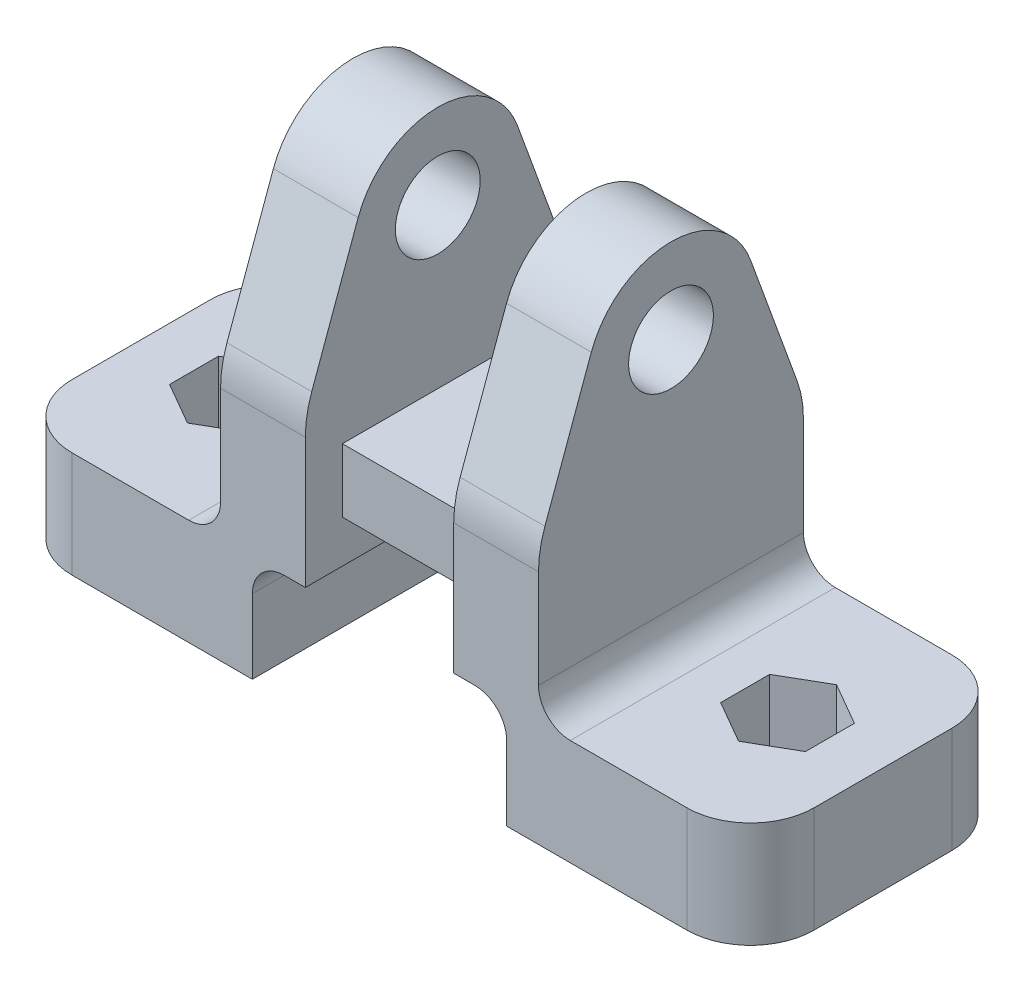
ISO-10303-21;
HEADER;
FILE_DESCRIPTION(('STEP AP214'),'2;1');
FILE_NAME('part.step','',(''),(''),'','','');
FILE_SCHEMA(('AUTOMOTIVE_DESIGN { 1 0 10303 214 1 1 1 1 }'));
ENDSEC;
DATA;
#1=APPLICATION_CONTEXT('core data for automotive mechanical design processes');
#2=APPLICATION_PROTOCOL_DEFINITION('international standard','automotive_design',2000,#1);
#3=PRODUCT_CONTEXT('',#1,'mechanical');
#4=PRODUCT('Part','Part','',(#3));
#5=PRODUCT_RELATED_PRODUCT_CATEGORY('part','',(#4));
#6=PRODUCT_DEFINITION_FORMATION('','',#4);
#7=PRODUCT_DEFINITION_CONTEXT('part definition',#1,'design');
#8=PRODUCT_DEFINITION('design','',#6,#7);
#9=PRODUCT_DEFINITION_SHAPE('','',#8);
#10=(LENGTH_UNIT() NAMED_UNIT(*) SI_UNIT(.MILLI.,.METRE.));
#11=(NAMED_UNIT(*) PLANE_ANGLE_UNIT() SI_UNIT($,.RADIAN.));
#12=(NAMED_UNIT(*) SI_UNIT($,.STERADIAN.) SOLID_ANGLE_UNIT());
#13=UNCERTAINTY_MEASURE_WITH_UNIT(LENGTH_MEASURE(1.E-05),#10,'distance_accuracy_value','');
#14=(GEOMETRIC_REPRESENTATION_CONTEXT(3) GLOBAL_UNCERTAINTY_ASSIGNED_CONTEXT((#13)) GLOBAL_UNIT_ASSIGNED_CONTEXT((#10,
#11,#12)) REPRESENTATION_CONTEXT('',''));
#15=CARTESIAN_POINT('',(0.,0.,0.));
#16=DIRECTION('',(0.,0.,1.));
#17=DIRECTION('',(1.,0.,0.));
#18=AXIS2_PLACEMENT_3D('',#15,#16,#17);
#19=CARTESIAN_POINT('',(-15.,24.046967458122,0.));
#20=DIRECTION('',(0.,0.,-1.));
#21=DIRECTION('',(0.,1.,0.));
#22=AXIS2_PLACEMENT_3D('',#19,#20,#21);
#23=PLANE('',#22);
#24=DIRECTION('',(0.,1.,0.));
#25=VECTOR('',#24,1.);
#26=CARTESIAN_POINT('',(-15.,24.046967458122,0.));
#27=LINE('',#26,#25);
#28=CARTESIAN_POINT('',(-15.,13.,0.));
#29=VERTEX_POINT('',#28);
#30=CARTESIAN_POINT('',(-15.,22.2836976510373,0.));
#31=VERTEX_POINT('',#30);
#32=EDGE_CURVE('E645',#29,#31,#27,.T.);
#33=ORIENTED_EDGE('',*,*,#32,.T.);
#34=DIRECTION('',(1.,0.,0.));
#35=VECTOR('',#34,1.);
#36=CARTESIAN_POINT('',(-15.,22.2836976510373,0.));
#37=LINE('',#36,#35);
#38=CARTESIAN_POINT('',(-7.,22.2836976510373,0.));
#39=VERTEX_POINT('',#38);
#40=EDGE_CURVE('E719',#31,#39,#37,.T.);
#41=ORIENTED_EDGE('',*,*,#40,.T.);
#42=DIRECTION('',(0.,1.,0.));
#43=VECTOR('',#42,1.);
#44=CARTESIAN_POINT('',(-7.,24.046967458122,0.));
#45=LINE('',#44,#43);
#46=CARTESIAN_POINT('',(-7.,10.,0.));
#47=VERTEX_POINT('',#46);
#48=EDGE_CURVE('E644',#47,#39,#45,.T.);
#49=ORIENTED_EDGE('',*,*,#48,.F.);
#50=DIRECTION('',(1.,0.,0.));
#51=VECTOR('',#50,1.);
#52=CARTESIAN_POINT('',(-15.,10.,0.));
#53=LINE('',#52,#51);
#54=CARTESIAN_POINT('',(-9.,10.,0.));
#55=VERTEX_POINT('',#54);
#56=EDGE_CURVE('E673',#55,#47,#53,.T.);
#57=ORIENTED_EDGE('',*,*,#56,.F.);
#58=CARTESIAN_POINT('',(-9.,7.,0.));
#59=DIRECTION('',(0.,0.,-1.));
#60=DIRECTION('',(0.,1.,0.));
#61=AXIS2_PLACEMENT_3D('',#58,#59,#60);
#62=CIRCLE('',#61,3.);
#63=CARTESIAN_POINT('',(-12.,7.,0.));
#64=VERTEX_POINT('',#63);
#65=EDGE_CURVE('E699',#55,#64,#62,.F.);
#66=ORIENTED_EDGE('',*,*,#65,.T.);
#67=DIRECTION('',(0.,1.,0.));
#68=VECTOR('',#67,1.);
#69=CARTESIAN_POINT('',(-12.,0.,0.));
#70=LINE('',#69,#68);
#71=CARTESIAN_POINT('',(-12.,0.,0.));
#72=VERTEX_POINT('',#71);
#73=EDGE_CURVE('E641',#72,#64,#70,.T.);
#74=ORIENTED_EDGE('',*,*,#73,.F.);
#75=DIRECTION('',(1.,0.,0.));
#76=VECTOR('',#75,1.);
#77=CARTESIAN_POINT('',(-35.,0.,0.));
#78=LINE('',#77,#76);
#79=CARTESIAN_POINT('',(-29.,0.,0.));
#80=VERTEX_POINT('',#79);
#81=EDGE_CURVE('E624',#80,#72,#78,.T.);
#82=ORIENTED_EDGE('',*,*,#81,.F.);
#83=DIRECTION('',(0.,1.,0.));
#84=VECTOR('',#83,1.);
#85=CARTESIAN_POINT('',(-29.,10.,0.));
#86=LINE('',#85,#84);
#87=CARTESIAN_POINT('',(-29.,10.,0.));
#88=VERTEX_POINT('',#87);
#89=EDGE_CURVE('E701',#80,#88,#86,.T.);
#90=ORIENTED_EDGE('',*,*,#89,.T.);
#91=DIRECTION('',(1.,0.,0.));
#92=VECTOR('',#91,1.);
#93=CARTESIAN_POINT('',(-35.,10.,0.));
#94=LINE('',#93,#92);
#95=CARTESIAN_POINT('',(-18.,10.,0.));
#96=VERTEX_POINT('',#95);
#97=EDGE_CURVE('E635',#88,#96,#94,.T.);
#98=ORIENTED_EDGE('',*,*,#97,.T.);
#99=CARTESIAN_POINT('',(-18.,13.,0.));
#100=DIRECTION('',(0.,0.,-1.));
#101=DIRECTION('',(0.,1.,0.));
#102=AXIS2_PLACEMENT_3D('',#99,#100,#101);
#103=CIRCLE('',#102,3.);
#104=EDGE_CURVE('E693',#96,#29,#103,.F.);
#105=ORIENTED_EDGE('',*,*,#104,.T.);
#106=EDGE_LOOP('',(#33,#41,#49,#57,#66,#74,#82,#90,#98,#105));
#107=FACE_BOUND('',#106,.T.);
#108=ADVANCED_FACE('F35',(#107),#23,.T.);
#109=CARTESIAN_POINT('',(-15.,10.,0.));
#110=DIRECTION('',(0.,-1.,0.));
#111=DIRECTION('',(0.,0.,-1.));
#112=AXIS2_PLACEMENT_3D('',#109,#110,#111);
#113=PLANE('',#112);
#114=DIRECTION('',(1.,0.,0.));
#115=VECTOR('',#114,1.);
#116=CARTESIAN_POINT('',(-15.,10.,25.));
#117=LINE('',#116,#115);
#118=CARTESIAN_POINT('',(-9.,10.,25.));
#119=VERTEX_POINT('',#118);
#120=CARTESIAN_POINT('',(-7.,10.,25.));
#121=VERTEX_POINT('',#120);
#122=EDGE_CURVE('E676',#119,#121,#117,.T.);
#123=ORIENTED_EDGE('',*,*,#122,.F.);
#124=DIRECTION('',(0.,0.,1.));
#125=VECTOR('',#124,1.);
#126=CARTESIAN_POINT('',(-9.,10.,0.));
#127=LINE('',#126,#125);
#128=EDGE_CURVE('E691',#119,#55,#127,.F.);
#129=ORIENTED_EDGE('',*,*,#128,.T.);
#130=ORIENTED_EDGE('',*,*,#56,.T.);
#131=DIRECTION('',(0.,0.,-1.));
#132=VECTOR('',#131,1.);
#133=CARTESIAN_POINT('',(-7.,10.,0.));
#134=LINE('',#133,#132);
#135=EDGE_CURVE('E649',#121,#47,#134,.T.);
#136=ORIENTED_EDGE('',*,*,#135,.F.);
#137=EDGE_LOOP('',(#123,#129,#130,#136));
#138=FACE_BOUND('',#137,.T.);
#139=ADVANCED_FACE('F759',(#138),#113,.T.);
#140=CARTESIAN_POINT('',(-15.,10.,25.));
#141=DIRECTION('',(0.,0.,1.));
#142=DIRECTION('',(1.,0.,0.));
#143=AXIS2_PLACEMENT_3D('',#140,#141,#142);
#144=PLANE('',#143);
#145=DIRECTION('',(0.,-1.,0.));
#146=VECTOR('',#145,1.);
#147=CARTESIAN_POINT('',(-7.,10.,25.));
#148=LINE('',#147,#146);
#149=CARTESIAN_POINT('',(-7.,22.2836976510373,25.));
#150=VERTEX_POINT('',#149);
#151=EDGE_CURVE('E669',#150,#121,#148,.T.);
#152=ORIENTED_EDGE('',*,*,#151,.F.);
#153=DIRECTION('',(1.,0.,0.));
#154=VECTOR('',#153,1.);
#155=CARTESIAN_POINT('',(-15.,22.2836976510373,25.));
#156=LINE('',#155,#154);
#157=CARTESIAN_POINT('',(-15.,22.2836976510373,25.));
#158=VERTEX_POINT('',#157);
#159=EDGE_CURVE('E11',#150,#158,#156,.F.);
#160=ORIENTED_EDGE('',*,*,#159,.T.);
#161=DIRECTION('',(0.,-1.,0.));
#162=VECTOR('',#161,1.);
#163=CARTESIAN_POINT('',(-15.,10.,25.));
#164=LINE('',#163,#162);
#165=CARTESIAN_POINT('',(-15.,13.,25.));
#166=VERTEX_POINT('',#165);
#167=EDGE_CURVE('E656',#158,#166,#164,.T.);
#168=ORIENTED_EDGE('',*,*,#167,.T.);
#169=CARTESIAN_POINT('',(-18.,13.,25.));
#170=DIRECTION('',(0.,0.,1.));
#171=DIRECTION('',(1.,0.,0.));
#172=AXIS2_PLACEMENT_3D('',#169,#170,#171);
#173=CIRCLE('',#172,3.);
#174=CARTESIAN_POINT('',(-18.,10.,25.));
#175=VERTEX_POINT('',#174);
#176=EDGE_CURVE('E695',#166,#175,#173,.F.);
#177=ORIENTED_EDGE('',*,*,#176,.T.);
#178=DIRECTION('',(-1.,0.,0.));
#179=VECTOR('',#178,1.);
#180=CARTESIAN_POINT('',(-35.,10.,25.));
#181=LINE('',#180,#179);
#182=CARTESIAN_POINT('',(-29.,10.,25.));
#183=VERTEX_POINT('',#182);
#184=EDGE_CURVE('E625',#175,#183,#181,.T.);
#185=ORIENTED_EDGE('',*,*,#184,.T.);
#186=DIRECTION('',(0.,1.,0.));
#187=VECTOR('',#186,1.);
#188=CARTESIAN_POINT('',(-29.,0.,25.));
#189=LINE('',#188,#187);
#190=CARTESIAN_POINT('',(-29.,0.,25.));
#191=VERTEX_POINT('',#190);
#192=EDGE_CURVE('E717',#183,#191,#189,.F.);
#193=ORIENTED_EDGE('',*,*,#192,.T.);
#194=DIRECTION('',(-1.,0.,0.));
#195=VECTOR('',#194,1.);
#196=CARTESIAN_POINT('',(-35.,0.,25.));
#197=LINE('',#196,#195);
#198=CARTESIAN_POINT('',(-12.,0.,25.));
#199=VERTEX_POINT('',#198);
#200=EDGE_CURVE('E629',#199,#191,#197,.T.);
#201=ORIENTED_EDGE('',*,*,#200,.F.);
#202=DIRECTION('',(0.,1.,0.));
#203=VECTOR('',#202,1.);
#204=CARTESIAN_POINT('',(-12.,0.,25.));
#205=LINE('',#204,#203);
#206=CARTESIAN_POINT('',(-12.,7.,25.));
#207=VERTEX_POINT('',#206);
#208=EDGE_CURVE('E632',#199,#207,#205,.T.);
#209=ORIENTED_EDGE('',*,*,#208,.T.);
#210=CARTESIAN_POINT('',(-9.,7.,25.));
#211=DIRECTION('',(0.,0.,1.));
#212=DIRECTION('',(1.,0.,0.));
#213=AXIS2_PLACEMENT_3D('',#210,#211,#212);
#214=CIRCLE('',#213,3.);
#215=EDGE_CURVE('E697',#207,#119,#214,.F.);
#216=ORIENTED_EDGE('',*,*,#215,.T.);
#217=ORIENTED_EDGE('',*,*,#122,.T.);
#218=EDGE_LOOP('',(#152,#160,#168,#177,#185,#193,#201,#209,#216,#217));
#219=FACE_BOUND('',#218,.T.);
#220=ADVANCED_FACE('F771',(#219),#144,.T.);
#221=CARTESIAN_POINT('',(-15.,24.046967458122,25.));
#222=DIRECTION('',(0.,0.342020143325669,0.939692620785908));
#223=DIRECTION('',(0.,-0.939692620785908,0.342020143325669));
#224=AXIS2_PLACEMENT_3D('',#221,#222,#223);
#225=PLANE('',#224);
#226=DIRECTION('',(0.,-0.939692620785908,0.342020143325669));
#227=VECTOR('',#226,1.);
#228=CARTESIAN_POINT('',(-15.,24.046967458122,25.));
#229=LINE('',#228,#227);
#230=CARTESIAN_POINT('',(-15.,37.7361611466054,20.0175409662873));
#231=VERTEX_POINT('',#230);
#232=CARTESIAN_POINT('',(-15.,25.703899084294,24.3969262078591));
#233=VERTEX_POINT('',#232);
#234=EDGE_CURVE('E654',#231,#233,#229,.T.);
#235=ORIENTED_EDGE('',*,*,#234,.T.);
#236=DIRECTION('',(1.,0.,0.));
#237=VECTOR('',#236,1.);
#238=CARTESIAN_POINT('',(-15.,25.703899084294,24.3969262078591));
#239=LINE('',#238,#237);
#240=CARTESIAN_POINT('',(-7.,25.703899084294,24.3969262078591));
#241=VERTEX_POINT('',#240);
#242=EDGE_CURVE('E43',#233,#241,#239,.T.);
#243=ORIENTED_EDGE('',*,*,#242,.T.);
#244=DIRECTION('',(0.,-0.939692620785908,0.342020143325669));
#245=VECTOR('',#244,1.);
#246=CARTESIAN_POINT('',(-7.,24.046967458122,25.));
#247=LINE('',#246,#245);
#248=CARTESIAN_POINT('',(-7.,37.7361611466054,20.0175409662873));
#249=VERTEX_POINT('',#248);
#250=EDGE_CURVE('E666',#249,#241,#247,.T.);
#251=ORIENTED_EDGE('',*,*,#250,.F.);
#252=DIRECTION('',(1.,0.,0.));
#253=VECTOR('',#252,1.);
#254=CARTESIAN_POINT('',(-15.,37.7361611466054,20.0175409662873));
#255=LINE('',#254,#253);
#256=EDGE_CURVE('E679',#231,#249,#255,.T.);
#257=ORIENTED_EDGE('',*,*,#256,.F.);
#258=EDGE_LOOP('',(#235,#243,#251,#257));
#259=FACE_BOUND('',#258,.T.);
#260=ADVANCED_FACE('F734',(#259),#225,.T.);
#261=CARTESIAN_POINT('',(-15.,35.,12.5));
#262=DIRECTION('',(1.,0.,0.));
#263=DIRECTION('',(0.,0.,-1.));
#264=AXIS2_PLACEMENT_3D('',#261,#262,#263);
#265=CYLINDRICAL_SURFACE('',#264,8.);
#266=CARTESIAN_POINT('',(-7.,35.,12.5));
#267=DIRECTION('',(1.,0.,0.));
#268=DIRECTION('',(0.,0.,-1.));
#269=AXIS2_PLACEMENT_3D('',#266,#267,#268);
#270=CIRCLE('',#269,8.);
#271=CARTESIAN_POINT('',(-7.,37.7361611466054,4.98245903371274));
#272=VERTEX_POINT('',#271);
#273=EDGE_CURVE('E663',#272,#249,#270,.T.);
#274=ORIENTED_EDGE('',*,*,#273,.F.);
#275=DIRECTION('',(1.,0.,0.));
#276=VECTOR('',#275,1.);
#277=CARTESIAN_POINT('',(-15.,37.7361611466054,4.98245903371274));
#278=LINE('',#277,#276);
#279=CARTESIAN_POINT('',(-15.,37.7361611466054,4.98245903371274));
#280=VERTEX_POINT('',#279);
#281=EDGE_CURVE('E658',#280,#272,#278,.T.);
#282=ORIENTED_EDGE('',*,*,#281,.F.);
#283=CARTESIAN_POINT('',(-15.,35.,12.5));
#284=DIRECTION('',(1.,0.,0.));
#285=DIRECTION('',(0.,0.,-1.));
#286=AXIS2_PLACEMENT_3D('',#283,#284,#285);
#287=CIRCLE('',#286,8.);
#288=EDGE_CURVE('E651',#280,#231,#287,.T.);
#289=ORIENTED_EDGE('',*,*,#288,.T.);
#290=ORIENTED_EDGE('',*,*,#256,.T.);
#291=EDGE_LOOP('',(#274,#282,#289,#290));
#292=FACE_BOUND('',#291,.T.);
#293=ADVANCED_FACE('F742',(#292),#265,.T.);
#294=CARTESIAN_POINT('',(-15.,24.046967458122,0.));
#295=DIRECTION('',(0.,0.342020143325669,-0.939692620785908));
#296=DIRECTION('',(0.,0.939692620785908,0.342020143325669));
#297=AXIS2_PLACEMENT_3D('',#294,#295,#296);
#298=PLANE('',#297);
#299=DIRECTION('',(0.,0.939692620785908,0.342020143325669));
#300=VECTOR('',#299,1.);
#301=CARTESIAN_POINT('',(-7.,24.046967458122,0.));
#302=LINE('',#301,#300);
#303=CARTESIAN_POINT('',(-7.,25.703899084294,0.603073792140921));
#304=VERTEX_POINT('',#303);
#305=EDGE_CURVE('E661',#304,#272,#302,.T.);
#306=ORIENTED_EDGE('',*,*,#305,.F.);
#307=DIRECTION('',(1.,0.,0.));
#308=VECTOR('',#307,1.);
#309=CARTESIAN_POINT('',(-15.,25.703899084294,0.603073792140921));
#310=LINE('',#309,#308);
#311=CARTESIAN_POINT('',(-15.,25.703899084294,0.603073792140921));
#312=VERTEX_POINT('',#311);
#313=EDGE_CURVE('E726',#304,#312,#310,.F.);
#314=ORIENTED_EDGE('',*,*,#313,.T.);
#315=DIRECTION('',(0.,0.939692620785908,0.342020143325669));
#316=VECTOR('',#315,1.);
#317=CARTESIAN_POINT('',(-15.,24.046967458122,0.));
#318=LINE('',#317,#316);
#319=EDGE_CURVE('E648',#312,#280,#318,.T.);
#320=ORIENTED_EDGE('',*,*,#319,.T.);
#321=ORIENTED_EDGE('',*,*,#281,.T.);
#322=EDGE_LOOP('',(#306,#314,#320,#321));
#323=FACE_BOUND('',#322,.T.);
#324=ADVANCED_FACE('F816',(#323),#298,.T.);
#325=CARTESIAN_POINT('',(-15.,35.,12.5));
#326=DIRECTION('',(1.,0.,0.));
#327=DIRECTION('',(0.,0.,-1.));
#328=AXIS2_PLACEMENT_3D('',#325,#326,#327);
#329=PLANE('',#328);
#330=CARTESIAN_POINT('',(-15.,35.,12.5));
#331=DIRECTION('',(-1.,0.,0.));
#332=DIRECTION('',(0.,0.,1.));
#333=AXIS2_PLACEMENT_3D('',#330,#331,#332);
#334=CIRCLE('',#333,4.);
#335=CARTESIAN_POINT('',(-15.,35.,16.5));
#336=VERTEX_POINT('',#335);
#337=EDGE_CURVE('E580',#336,#336,#334,.T.);
#338=ORIENTED_EDGE('',*,*,#337,.F.);
#339=EDGE_LOOP('',(#338));
#340=FACE_BOUND('',#339,.T.);
#341=ORIENTED_EDGE('',*,*,#319,.F.);
#342=CARTESIAN_POINT('',(-15.,22.2836976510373,10.));
#343=DIRECTION('',(1.,0.,0.));
#344=DIRECTION('',(0.,0.,-1.));
#345=AXIS2_PLACEMENT_3D('',#342,#343,#344);
#346=CIRCLE('',#345,10.);
#347=EDGE_CURVE('E729',#312,#31,#346,.F.);
#348=ORIENTED_EDGE('',*,*,#347,.T.);
#349=ORIENTED_EDGE('',*,*,#32,.F.);
#350=DIRECTION('',(0.,0.,-1.));
#351=VECTOR('',#350,1.);
#352=CARTESIAN_POINT('',(-15.,13.,25.));
#353=LINE('',#352,#351);
#354=EDGE_CURVE('E685',#29,#166,#353,.F.);
#355=ORIENTED_EDGE('',*,*,#354,.T.);
#356=ORIENTED_EDGE('',*,*,#167,.F.);
#357=CARTESIAN_POINT('',(-15.,22.2836976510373,15.));
#358=DIRECTION('',(1.,0.,0.));
#359=DIRECTION('',(0.,0.,-1.));
#360=AXIS2_PLACEMENT_3D('',#357,#358,#359);
#361=CIRCLE('',#360,10.);
#362=EDGE_CURVE('E50',#158,#233,#361,.F.);
#363=ORIENTED_EDGE('',*,*,#362,.T.);
#364=ORIENTED_EDGE('',*,*,#234,.F.);
#365=ORIENTED_EDGE('',*,*,#288,.F.);
#366=EDGE_LOOP('',(#341,#348,#349,#355,#356,#363,#364,#365));
#367=FACE_BOUND('',#366,.T.);
#368=ADVANCED_FACE('F745',(#340,#367),#329,.F.);
#369=CARTESIAN_POINT('',(-7.,35.,12.5));
#370=DIRECTION('',(1.,0.,0.));
#371=DIRECTION('',(0.,0.,-1.));
#372=AXIS2_PLACEMENT_3D('',#369,#370,#371);
#373=PLANE('',#372);
#374=CARTESIAN_POINT('',(-7.,35.,12.5));
#375=DIRECTION('',(1.,0.,0.));
#376=DIRECTION('',(0.,0.,-1.));
#377=AXIS2_PLACEMENT_3D('',#374,#375,#376);
#378=CIRCLE('',#377,4.);
#379=CARTESIAN_POINT('',(-7.,35.,8.50000000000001));
#380=VERTEX_POINT('',#379);
#381=EDGE_CURVE('E593',#380,#380,#378,.T.);
#382=ORIENTED_EDGE('',*,*,#381,.F.);
#383=EDGE_LOOP('',(#382));
#384=FACE_BOUND('',#383,.T.);
#385=DIRECTION('',(0.,1.,0.));
#386=VECTOR('',#385,1.);
#387=CARTESIAN_POINT('',(-7.,14.,3.5));
#388=LINE('',#387,#386);
#389=CARTESIAN_POINT('',(-7.,14.,3.5));
#390=VERTEX_POINT('',#389);
#391=CARTESIAN_POINT('',(-7.,20.,3.5));
#392=VERTEX_POINT('',#391);
#393=EDGE_CURVE('E596',#390,#392,#388,.T.);
#394=ORIENTED_EDGE('',*,*,#393,.F.);
#395=DIRECTION('',(0.,0.,-1.));
#396=VECTOR('',#395,1.);
#397=CARTESIAN_POINT('',(-7.,14.,21.5));
#398=LINE('',#397,#396);
#399=CARTESIAN_POINT('',(-7.,14.,21.5));
#400=VERTEX_POINT('',#399);
#401=EDGE_CURVE('E605',#400,#390,#398,.T.);
#402=ORIENTED_EDGE('',*,*,#401,.F.);
#403=DIRECTION('',(0.,-1.,0.));
#404=VECTOR('',#403,1.);
#405=CARTESIAN_POINT('',(-7.,14.,21.5));
#406=LINE('',#405,#404);
#407=CARTESIAN_POINT('',(-7.,20.,21.5));
#408=VERTEX_POINT('',#407);
#409=EDGE_CURVE('E602',#408,#400,#406,.T.);
#410=ORIENTED_EDGE('',*,*,#409,.F.);
#411=DIRECTION('',(0.,0.,1.));
#412=VECTOR('',#411,1.);
#413=CARTESIAN_POINT('',(-7.,20.,21.5));
#414=LINE('',#413,#412);
#415=EDGE_CURVE('E599',#392,#408,#414,.T.);
#416=ORIENTED_EDGE('',*,*,#415,.F.);
#417=EDGE_LOOP('',(#394,#402,#410,#416));
#418=FACE_BOUND('',#417,.T.);
#419=ORIENTED_EDGE('',*,*,#48,.T.);
#420=CARTESIAN_POINT('',(-7.,22.2836976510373,10.));
#421=DIRECTION('',(1.,0.,0.));
#422=DIRECTION('',(0.,0.,-1.));
#423=AXIS2_PLACEMENT_3D('',#420,#421,#422);
#424=CIRCLE('',#423,10.);
#425=EDGE_CURVE('E724',#39,#304,#424,.T.);
#426=ORIENTED_EDGE('',*,*,#425,.T.);
#427=ORIENTED_EDGE('',*,*,#305,.T.);
#428=ORIENTED_EDGE('',*,*,#273,.T.);
#429=ORIENTED_EDGE('',*,*,#250,.T.);
#430=CARTESIAN_POINT('',(-7.,22.2836976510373,15.));
#431=DIRECTION('',(1.,0.,0.));
#432=DIRECTION('',(0.,0.,-1.));
#433=AXIS2_PLACEMENT_3D('',#430,#431,#432);
#434=CIRCLE('',#433,10.);
#435=EDGE_CURVE('E722',#241,#150,#434,.T.);
#436=ORIENTED_EDGE('',*,*,#435,.T.);
#437=ORIENTED_EDGE('',*,*,#151,.T.);
#438=ORIENTED_EDGE('',*,*,#135,.T.);
#439=EDGE_LOOP('',(#419,#426,#427,#428,#429,#436,#437,#438));
#440=FACE_BOUND('',#439,.T.);
#441=ADVANCED_FACE('F737',(#384,#418,#440),#373,.T.);
#442=CARTESIAN_POINT('',(0.,10.,0.));
#443=DIRECTION('',(0.,-1.,0.));
#444=DIRECTION('',(0.,0.,-1.));
#445=AXIS2_PLACEMENT_3D('',#442,#443,#444);
#446=PLANE('',#445);
#447=DIRECTION('',(0.,0.,1.));
#448=VECTOR('',#447,1.);
#449=CARTESIAN_POINT('',(-30.,10.,10.1905989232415));
#450=LINE('',#449,#448);
#451=CARTESIAN_POINT('',(-30.,10.,10.1905989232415));
#452=VERTEX_POINT('',#451);
#453=CARTESIAN_POINT('',(-30.,10.,14.8094010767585));
#454=VERTEX_POINT('',#453);
#455=EDGE_CURVE('E564',#452,#454,#450,.T.);
#456=ORIENTED_EDGE('',*,*,#455,.F.);
#457=DIRECTION('',(-0.866025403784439,0.,0.5));
#458=VECTOR('',#457,1.);
#459=CARTESIAN_POINT('',(-26.,10.,7.88119784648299));
#460=LINE('',#459,#458);
#461=CARTESIAN_POINT('',(-26.,10.,7.88119784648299));
#462=VERTEX_POINT('',#461);
#463=EDGE_CURVE('E542',#462,#452,#460,.T.);
#464=ORIENTED_EDGE('',*,*,#463,.F.);
#465=DIRECTION('',(-0.866025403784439,0.,-0.5));
#466=VECTOR('',#465,1.);
#467=CARTESIAN_POINT('',(-22.,10.,10.1905989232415));
#468=LINE('',#467,#466);
#469=CARTESIAN_POINT('',(-22.,10.,10.1905989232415));
#470=VERTEX_POINT('',#469);
#471=EDGE_CURVE('E547',#470,#462,#468,.T.);
#472=ORIENTED_EDGE('',*,*,#471,.F.);
#473=DIRECTION('',(0.,0.,-1.));
#474=VECTOR('',#473,1.);
#475=CARTESIAN_POINT('',(-22.,10.,14.8094010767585));
#476=LINE('',#475,#474);
#477=CARTESIAN_POINT('',(-22.,10.,14.8094010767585));
#478=VERTEX_POINT('',#477);
#479=EDGE_CURVE('E573',#478,#470,#476,.T.);
#480=ORIENTED_EDGE('',*,*,#479,.F.);
#481=DIRECTION('',(0.866025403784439,0.,-0.5));
#482=VECTOR('',#481,1.);
#483=CARTESIAN_POINT('',(-26.,10.,17.118802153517));
#484=LINE('',#483,#482);
#485=CARTESIAN_POINT('',(-26.,10.,17.118802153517));
#486=VERTEX_POINT('',#485);
#487=EDGE_CURVE('E570',#486,#478,#484,.T.);
#488=ORIENTED_EDGE('',*,*,#487,.F.);
#489=DIRECTION('',(0.866025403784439,0.,0.5));
#490=VECTOR('',#489,1.);
#491=CARTESIAN_POINT('',(-30.,10.,14.8094010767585));
#492=LINE('',#491,#490);
#493=EDGE_CURVE('E567',#454,#486,#492,.T.);
#494=ORIENTED_EDGE('',*,*,#493,.F.);
#495=EDGE_LOOP('',(#456,#464,#472,#480,#488,#494));
#496=FACE_BOUND('',#495,.T.);
#497=ORIENTED_EDGE('',*,*,#97,.F.);
#498=CARTESIAN_POINT('',(-29.,10.,6.));
#499=DIRECTION('',(0.,-1.,0.));
#500=DIRECTION('',(0.,0.,-1.));
#501=AXIS2_PLACEMENT_3D('',#498,#499,#500);
#502=CIRCLE('',#501,6.);
#503=CARTESIAN_POINT('',(-35.,10.,6.));
#504=VERTEX_POINT('',#503);
#505=EDGE_CURVE('E706',#88,#504,#502,.F.);
#506=ORIENTED_EDGE('',*,*,#505,.T.);
#507=DIRECTION('',(0.,0.,-1.));
#508=VECTOR('',#507,1.);
#509=CARTESIAN_POINT('',(-35.,10.,25.));
#510=LINE('',#509,#508);
#511=CARTESIAN_POINT('',(-35.,10.,19.));
#512=VERTEX_POINT('',#511);
#513=EDGE_CURVE('E620',#512,#504,#510,.T.);
#514=ORIENTED_EDGE('',*,*,#513,.F.);
#515=CARTESIAN_POINT('',(-29.,10.,19.));
#516=DIRECTION('',(0.,-1.,0.));
#517=DIRECTION('',(0.,0.,-1.));
#518=AXIS2_PLACEMENT_3D('',#515,#516,#517);
#519=CIRCLE('',#518,6.);
#520=EDGE_CURVE('E704',#512,#183,#519,.F.);
#521=ORIENTED_EDGE('',*,*,#520,.T.);
#522=ORIENTED_EDGE('',*,*,#184,.F.);
#523=DIRECTION('',(0.,0.,-1.));
#524=VECTOR('',#523,1.);
#525=CARTESIAN_POINT('',(-18.,10.,0.));
#526=LINE('',#525,#524);
#527=EDGE_CURVE('E675',#175,#96,#526,.T.);
#528=ORIENTED_EDGE('',*,*,#527,.T.);
#529=EDGE_LOOP('',(#497,#506,#514,#521,#522,#528));
#530=FACE_BOUND('',#529,.T.);
#531=ADVANCED_FACE('F786',(#496,#530),#446,.F.);
#532=CARTESIAN_POINT('',(-35.,0.,25.));
#533=DIRECTION('',(1.,0.,0.));
#534=DIRECTION('',(0.,0.,-1.));
#535=AXIS2_PLACEMENT_3D('',#532,#533,#534);
#536=PLANE('',#535);
#537=ORIENTED_EDGE('',*,*,#513,.T.);
#538=DIRECTION('',(0.,1.,0.));
#539=VECTOR('',#538,1.);
#540=CARTESIAN_POINT('',(-35.,0.,6.));
#541=LINE('',#540,#539);
#542=CARTESIAN_POINT('',(-35.,0.,6.));
#543=VERTEX_POINT('',#542);
#544=EDGE_CURVE('E711',#504,#543,#541,.F.);
#545=ORIENTED_EDGE('',*,*,#544,.T.);
#546=DIRECTION('',(0.,0.,-1.));
#547=VECTOR('',#546,1.);
#548=CARTESIAN_POINT('',(-35.,0.,25.));
#549=LINE('',#548,#547);
#550=CARTESIAN_POINT('',(-35.,0.,19.));
#551=VERTEX_POINT('',#550);
#552=EDGE_CURVE('E621',#551,#543,#549,.T.);
#553=ORIENTED_EDGE('',*,*,#552,.F.);
#554=DIRECTION('',(0.,1.,0.));
#555=VECTOR('',#554,1.);
#556=CARTESIAN_POINT('',(-35.,10.,19.));
#557=LINE('',#556,#555);
#558=EDGE_CURVE('E708',#551,#512,#557,.T.);
#559=ORIENTED_EDGE('',*,*,#558,.T.);
#560=EDGE_LOOP('',(#537,#545,#553,#559));
#561=FACE_BOUND('',#560,.T.);
#562=ADVANCED_FACE('F782',(#561),#536,.F.);
#563=CARTESIAN_POINT('',(-12.,0.,25.));
#564=DIRECTION('',(-1.,0.,0.));
#565=DIRECTION('',(0.,0.,1.));
#566=AXIS2_PLACEMENT_3D('',#563,#564,#565);
#567=PLANE('',#566);
#568=ORIENTED_EDGE('',*,*,#73,.T.);
#569=DIRECTION('',(0.,0.,1.));
#570=VECTOR('',#569,1.);
#571=CARTESIAN_POINT('',(-12.,7.,25.));
#572=LINE('',#571,#570);
#573=EDGE_CURVE('E688',#64,#207,#572,.T.);
#574=ORIENTED_EDGE('',*,*,#573,.T.);
#575=ORIENTED_EDGE('',*,*,#208,.F.);
#576=DIRECTION('',(0.,0.,1.));
#577=VECTOR('',#576,1.);
#578=CARTESIAN_POINT('',(-12.,0.,25.));
#579=LINE('',#578,#577);
#580=EDGE_CURVE('E627',#72,#199,#579,.T.);
#581=ORIENTED_EDGE('',*,*,#580,.F.);
#582=EDGE_LOOP('',(#568,#574,#575,#581));
#583=FACE_BOUND('',#582,.T.);
#584=ADVANCED_FACE('F768',(#583),#567,.F.);
#585=CARTESIAN_POINT('',(0.,0.,0.));
#586=DIRECTION('',(0.,-1.,0.));
#587=DIRECTION('',(0.,0.,-1.));
#588=AXIS2_PLACEMENT_3D('',#585,#586,#587);
#589=PLANE('',#588);
#590=DIRECTION('',(-0.866025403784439,0.,0.5));
#591=VECTOR('',#590,1.);
#592=CARTESIAN_POINT('',(-26.,0.,7.88119784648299));
#593=LINE('',#592,#591);
#594=CARTESIAN_POINT('',(-26.,0.,7.88119784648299));
#595=VERTEX_POINT('',#594);
#596=CARTESIAN_POINT('',(-30.,0.,10.1905989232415));
#597=VERTEX_POINT('',#596);
#598=EDGE_CURVE('E543',#595,#597,#593,.T.);
#599=ORIENTED_EDGE('',*,*,#598,.T.);
#600=DIRECTION('',(0.,0.,1.));
#601=VECTOR('',#600,1.);
#602=CARTESIAN_POINT('',(-30.,0.,10.1905989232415));
#603=LINE('',#602,#601);
#604=CARTESIAN_POINT('',(-30.,0.,14.8094010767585));
#605=VERTEX_POINT('',#604);
#606=EDGE_CURVE('E546',#597,#605,#603,.T.);
#607=ORIENTED_EDGE('',*,*,#606,.T.);
#608=DIRECTION('',(0.866025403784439,0.,0.5));
#609=VECTOR('',#608,1.);
#610=CARTESIAN_POINT('',(-30.,0.,14.8094010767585));
#611=LINE('',#610,#609);
#612=CARTESIAN_POINT('',(-26.,0.,17.118802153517));
#613=VERTEX_POINT('',#612);
#614=EDGE_CURVE('E550',#605,#613,#611,.T.);
#615=ORIENTED_EDGE('',*,*,#614,.T.);
#616=DIRECTION('',(0.866025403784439,0.,-0.5));
#617=VECTOR('',#616,1.);
#618=CARTESIAN_POINT('',(-26.,0.,17.118802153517));
#619=LINE('',#618,#617);
#620=CARTESIAN_POINT('',(-22.,0.,14.8094010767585));
#621=VERTEX_POINT('',#620);
#622=EDGE_CURVE('E553',#613,#621,#619,.T.);
#623=ORIENTED_EDGE('',*,*,#622,.T.);
#624=DIRECTION('',(0.,0.,-1.));
#625=VECTOR('',#624,1.);
#626=CARTESIAN_POINT('',(-22.,0.,14.8094010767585));
#627=LINE('',#626,#625);
#628=CARTESIAN_POINT('',(-22.,0.,10.1905989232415));
#629=VERTEX_POINT('',#628);
#630=EDGE_CURVE('E556',#621,#629,#627,.T.);
#631=ORIENTED_EDGE('',*,*,#630,.T.);
#632=DIRECTION('',(-0.866025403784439,0.,-0.5));
#633=VECTOR('',#632,1.);
#634=CARTESIAN_POINT('',(-22.,0.,10.1905989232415));
#635=LINE('',#634,#633);
#636=EDGE_CURVE('E559',#629,#595,#635,.T.);
#637=ORIENTED_EDGE('',*,*,#636,.T.);
#638=EDGE_LOOP('',(#599,#607,#615,#623,#631,#637));
#639=FACE_BOUND('',#638,.T.);
#640=ORIENTED_EDGE('',*,*,#552,.T.);
#641=CARTESIAN_POINT('',(-29.,0.,6.));
#642=DIRECTION('',(0.,-1.,0.));
#643=DIRECTION('',(0.,0.,-1.));
#644=AXIS2_PLACEMENT_3D('',#641,#642,#643);
#645=CIRCLE('',#644,6.);
#646=EDGE_CURVE('E715',#543,#80,#645,.T.);
#647=ORIENTED_EDGE('',*,*,#646,.T.);
#648=ORIENTED_EDGE('',*,*,#81,.T.);
#649=ORIENTED_EDGE('',*,*,#580,.T.);
#650=ORIENTED_EDGE('',*,*,#200,.T.);
#651=CARTESIAN_POINT('',(-29.,0.,19.));
#652=DIRECTION('',(0.,-1.,0.));
#653=DIRECTION('',(0.,0.,-1.));
#654=AXIS2_PLACEMENT_3D('',#651,#652,#653);
#655=CIRCLE('',#654,6.);
#656=EDGE_CURVE('E713',#191,#551,#655,.T.);
#657=ORIENTED_EDGE('',*,*,#656,.T.);
#658=EDGE_LOOP('',(#640,#647,#648,#649,#650,#657));
#659=FACE_BOUND('',#658,.T.);
#660=ADVANCED_FACE('F775',(#639,#659),#589,.T.);
#661=CARTESIAN_POINT('',(0.,14.,3.5));
#662=DIRECTION('',(0.,0.,1.));
#663=DIRECTION('',(1.,0.,0.));
#664=AXIS2_PLACEMENT_3D('',#661,#662,#663);
#665=PLANE('',#664);
#666=ORIENTED_EDGE('',*,*,#393,.T.);
#667=DIRECTION('',(-1.,0.,0.));
#668=VECTOR('',#667,1.);
#669=CARTESIAN_POINT('',(0.,20.,3.5));
#670=LINE('',#669,#668);
#671=CARTESIAN_POINT('',(7.,20.,3.5));
#672=VERTEX_POINT('',#671);
#673=EDGE_CURVE('E617',#672,#392,#670,.T.);
#674=ORIENTED_EDGE('',*,*,#673,.F.);
#675=DIRECTION('',(0.,1.,0.));
#676=VECTOR('',#675,1.);
#677=CARTESIAN_POINT('',(7.,14.,3.5));
#678=LINE('',#677,#676);
#679=CARTESIAN_POINT('',(7.,14.,3.5));
#680=VERTEX_POINT('',#679);
#681=EDGE_CURVE('E406',#680,#672,#678,.T.);
#682=ORIENTED_EDGE('',*,*,#681,.F.);
#683=DIRECTION('',(-1.,0.,0.));
#684=VECTOR('',#683,1.);
#685=CARTESIAN_POINT('',(0.,14.,3.5));
#686=LINE('',#685,#684);
#687=EDGE_CURVE('E608',#680,#390,#686,.T.);
#688=ORIENTED_EDGE('',*,*,#687,.T.);
#689=EDGE_LOOP('',(#666,#674,#682,#688));
#690=FACE_BOUND('',#689,.T.);
#691=ADVANCED_FACE('F937',(#690),#665,.F.);
#692=CARTESIAN_POINT('',(0.,20.,21.5));
#693=DIRECTION('',(0.,-1.,0.));
#694=DIRECTION('',(0.,0.,-1.));
#695=AXIS2_PLACEMENT_3D('',#692,#693,#694);
#696=PLANE('',#695);
#697=ORIENTED_EDGE('',*,*,#415,.T.);
#698=DIRECTION('',(-1.,0.,0.));
#699=VECTOR('',#698,1.);
#700=CARTESIAN_POINT('',(0.,20.,21.5));
#701=LINE('',#700,#699);
#702=CARTESIAN_POINT('',(7.,20.,21.5));
#703=VERTEX_POINT('',#702);
#704=EDGE_CURVE('E614',#703,#408,#701,.T.);
#705=ORIENTED_EDGE('',*,*,#704,.F.);
#706=DIRECTION('',(0.,0.,1.));
#707=VECTOR('',#706,1.);
#708=CARTESIAN_POINT('',(7.,20.,21.5));
#709=LINE('',#708,#707);
#710=EDGE_CURVE('E409',#672,#703,#709,.T.);
#711=ORIENTED_EDGE('',*,*,#710,.F.);
#712=ORIENTED_EDGE('',*,*,#673,.T.);
#713=EDGE_LOOP('',(#697,#705,#711,#712));
#714=FACE_BOUND('',#713,.T.);
#715=ADVANCED_FACE('F1016',(#714),#696,.F.);
#716=CARTESIAN_POINT('',(0.,14.,21.5));
#717=DIRECTION('',(0.,0.,-1.));
#718=DIRECTION('',(-1.,0.,0.));
#719=AXIS2_PLACEMENT_3D('',#716,#717,#718);
#720=PLANE('',#719);
#721=ORIENTED_EDGE('',*,*,#409,.T.);
#722=DIRECTION('',(-1.,0.,0.));
#723=VECTOR('',#722,1.);
#724=CARTESIAN_POINT('',(0.,14.,21.5));
#725=LINE('',#724,#723);
#726=CARTESIAN_POINT('',(7.,14.,21.5));
#727=VERTEX_POINT('',#726);
#728=EDGE_CURVE('E611',#727,#400,#725,.T.);
#729=ORIENTED_EDGE('',*,*,#728,.F.);
#730=DIRECTION('',(0.,-1.,0.));
#731=VECTOR('',#730,1.);
#732=CARTESIAN_POINT('',(7.,14.,21.5));
#733=LINE('',#732,#731);
#734=EDGE_CURVE('E412',#703,#727,#733,.T.);
#735=ORIENTED_EDGE('',*,*,#734,.F.);
#736=ORIENTED_EDGE('',*,*,#704,.T.);
#737=EDGE_LOOP('',(#721,#729,#735,#736));
#738=FACE_BOUND('',#737,.T.);
#739=ADVANCED_FACE('F1026',(#738),#720,.F.);
#740=CARTESIAN_POINT('',(0.,14.,21.5));
#741=DIRECTION('',(0.,1.,0.));
#742=DIRECTION('',(0.,0.,1.));
#743=AXIS2_PLACEMENT_3D('',#740,#741,#742);
#744=PLANE('',#743);
#745=ORIENTED_EDGE('',*,*,#401,.T.);
#746=ORIENTED_EDGE('',*,*,#687,.F.);
#747=DIRECTION('',(0.,0.,-1.));
#748=VECTOR('',#747,1.);
#749=CARTESIAN_POINT('',(7.,14.,21.5));
#750=LINE('',#749,#748);
#751=EDGE_CURVE('E415',#727,#680,#750,.T.);
#752=ORIENTED_EDGE('',*,*,#751,.F.);
#753=ORIENTED_EDGE('',*,*,#728,.T.);
#754=EDGE_LOOP('',(#745,#746,#752,#753));
#755=FACE_BOUND('',#754,.T.);
#756=ADVANCED_FACE('F949',(#755),#744,.F.);
#757=CARTESIAN_POINT('',(-15.,35.,12.5));
#758=DIRECTION('',(-1.,0.,0.));
#759=DIRECTION('',(0.,0.,1.));
#760=AXIS2_PLACEMENT_3D('',#757,#758,#759);
#761=CYLINDRICAL_SURFACE('',#760,4.);
#762=ORIENTED_EDGE('',*,*,#381,.T.);
#763=EDGE_LOOP('',(#762));
#764=FACE_BOUND('',#763,.T.);
#765=ORIENTED_EDGE('',*,*,#337,.T.);
#766=EDGE_LOOP('',(#765));
#767=FACE_BOUND('',#766,.T.);
#768=ADVANCED_FACE('F943',(#764,#767),#761,.F.);
#769=CARTESIAN_POINT('',(-26.,0.,7.88119784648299));
#770=DIRECTION('',(-0.5,0.,-0.866025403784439));
#771=DIRECTION('',(-0.866025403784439,0.,0.5));
#772=AXIS2_PLACEMENT_3D('',#769,#770,#771);
#773=PLANE('',#772);
#774=ORIENTED_EDGE('',*,*,#463,.T.);
#775=DIRECTION('',(0.,1.,0.));
#776=VECTOR('',#775,1.);
#777=CARTESIAN_POINT('',(-30.,0.,10.1905989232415));
#778=LINE('',#777,#776);
#779=EDGE_CURVE('E562',#597,#452,#778,.T.);
#780=ORIENTED_EDGE('',*,*,#779,.F.);
#781=ORIENTED_EDGE('',*,*,#598,.F.);
#782=DIRECTION('',(0.,1.,0.));
#783=VECTOR('',#782,1.);
#784=CARTESIAN_POINT('',(-26.,0.,7.88119784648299));
#785=LINE('',#784,#783);
#786=EDGE_CURVE('E578',#595,#462,#785,.T.);
#787=ORIENTED_EDGE('',*,*,#786,.T.);
#788=EDGE_LOOP('',(#774,#780,#781,#787));
#789=FACE_BOUND('',#788,.T.);
#790=ADVANCED_FACE('F948',(#789),#773,.F.);
#791=CARTESIAN_POINT('',(-22.,0.,10.1905989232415));
#792=DIRECTION('',(0.5,0.,-0.866025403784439));
#793=DIRECTION('',(-0.866025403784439,0.,-0.5));
#794=AXIS2_PLACEMENT_3D('',#791,#792,#793);
#795=PLANE('',#794);
#796=ORIENTED_EDGE('',*,*,#471,.T.);
#797=ORIENTED_EDGE('',*,*,#786,.F.);
#798=ORIENTED_EDGE('',*,*,#636,.F.);
#799=DIRECTION('',(0.,1.,0.));
#800=VECTOR('',#799,1.);
#801=CARTESIAN_POINT('',(-22.,0.,10.1905989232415));
#802=LINE('',#801,#800);
#803=EDGE_CURVE('E581',#629,#470,#802,.T.);
#804=ORIENTED_EDGE('',*,*,#803,.T.);
#805=EDGE_LOOP('',(#796,#797,#798,#804));
#806=FACE_BOUND('',#805,.T.);
#807=ADVANCED_FACE('F959',(#806),#795,.F.);
#808=CARTESIAN_POINT('',(-22.,0.,14.8094010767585));
#809=DIRECTION('',(1.,0.,0.));
#810=DIRECTION('',(0.,0.,-1.));
#811=AXIS2_PLACEMENT_3D('',#808,#809,#810);
#812=PLANE('',#811);
#813=ORIENTED_EDGE('',*,*,#479,.T.);
#814=ORIENTED_EDGE('',*,*,#803,.F.);
#815=ORIENTED_EDGE('',*,*,#630,.F.);
#816=DIRECTION('',(0.,1.,0.));
#817=VECTOR('',#816,1.);
#818=CARTESIAN_POINT('',(-22.,0.,14.8094010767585));
#819=LINE('',#818,#817);
#820=EDGE_CURVE('E583',#621,#478,#819,.T.);
#821=ORIENTED_EDGE('',*,*,#820,.T.);
#822=EDGE_LOOP('',(#813,#814,#815,#821));
#823=FACE_BOUND('',#822,.T.);
#824=ADVANCED_FACE('F968',(#823),#812,.F.);
#825=CARTESIAN_POINT('',(-26.,0.,17.118802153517));
#826=DIRECTION('',(0.5,0.,0.866025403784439));
#827=DIRECTION('',(0.866025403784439,0.,-0.5));
#828=AXIS2_PLACEMENT_3D('',#825,#826,#827);
#829=PLANE('',#828);
#830=ORIENTED_EDGE('',*,*,#487,.T.);
#831=ORIENTED_EDGE('',*,*,#820,.F.);
#832=ORIENTED_EDGE('',*,*,#622,.F.);
#833=DIRECTION('',(0.,1.,0.));
#834=VECTOR('',#833,1.);
#835=CARTESIAN_POINT('',(-26.,0.,17.118802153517));
#836=LINE('',#835,#834);
#837=EDGE_CURVE('E585',#613,#486,#836,.T.);
#838=ORIENTED_EDGE('',*,*,#837,.T.);
#839=EDGE_LOOP('',(#830,#831,#832,#838));
#840=FACE_BOUND('',#839,.T.);
#841=ADVANCED_FACE('F977',(#840),#829,.F.);
#842=CARTESIAN_POINT('',(-30.,0.,14.8094010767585));
#843=DIRECTION('',(-0.5,0.,0.866025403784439));
#844=DIRECTION('',(0.866025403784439,0.,0.5));
#845=AXIS2_PLACEMENT_3D('',#842,#843,#844);
#846=PLANE('',#845);
#847=ORIENTED_EDGE('',*,*,#493,.T.);
#848=ORIENTED_EDGE('',*,*,#837,.F.);
#849=ORIENTED_EDGE('',*,*,#614,.F.);
#850=DIRECTION('',(0.,1.,0.));
#851=VECTOR('',#850,1.);
#852=CARTESIAN_POINT('',(-30.,0.,14.8094010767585));
#853=LINE('',#852,#851);
#854=EDGE_CURVE('E587',#605,#454,#853,.T.);
#855=ORIENTED_EDGE('',*,*,#854,.T.);
#856=EDGE_LOOP('',(#847,#848,#849,#855));
#857=FACE_BOUND('',#856,.T.);
#858=ADVANCED_FACE('F986',(#857),#846,.F.);
#859=CARTESIAN_POINT('',(-30.,0.,10.1905989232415));
#860=DIRECTION('',(-1.,0.,0.));
#861=DIRECTION('',(0.,0.,1.));
#862=AXIS2_PLACEMENT_3D('',#859,#860,#861);
#863=PLANE('',#862);
#864=ORIENTED_EDGE('',*,*,#455,.T.);
#865=ORIENTED_EDGE('',*,*,#854,.F.);
#866=ORIENTED_EDGE('',*,*,#606,.F.);
#867=ORIENTED_EDGE('',*,*,#779,.T.);
#868=EDGE_LOOP('',(#864,#865,#866,#867));
#869=FACE_BOUND('',#868,.T.);
#870=ADVANCED_FACE('F820',(#869),#863,.F.);
#871=CARTESIAN_POINT('',(-18.,13.,0.));
#872=DIRECTION('',(0.,0.,1.));
#873=DIRECTION('',(0.,-1.,0.));
#874=AXIS2_PLACEMENT_3D('',#871,#872,#873);
#875=CYLINDRICAL_SURFACE('',#874,3.);
#876=ORIENTED_EDGE('',*,*,#176,.F.);
#877=ORIENTED_EDGE('',*,*,#354,.F.);
#878=ORIENTED_EDGE('',*,*,#104,.F.);
#879=ORIENTED_EDGE('',*,*,#527,.F.);
#880=EDGE_LOOP('',(#876,#877,#878,#879));
#881=FACE_BOUND('',#880,.T.);
#882=ADVANCED_FACE('F798',(#881),#875,.F.);
#883=CARTESIAN_POINT('',(-9.,7.,25.));
#884=DIRECTION('',(0.,0.,1.));
#885=DIRECTION('',(1.,0.,0.));
#886=AXIS2_PLACEMENT_3D('',#883,#884,#885);
#887=CYLINDRICAL_SURFACE('',#886,3.);
#888=ORIENTED_EDGE('',*,*,#65,.F.);
#889=ORIENTED_EDGE('',*,*,#128,.F.);
#890=ORIENTED_EDGE('',*,*,#215,.F.);
#891=ORIENTED_EDGE('',*,*,#573,.F.);
#892=EDGE_LOOP('',(#888,#889,#890,#891));
#893=FACE_BOUND('',#892,.T.);
#894=ADVANCED_FACE('F765',(#893),#887,.F.);
#895=CARTESIAN_POINT('',(-29.,24.046967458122,6.));
#896=DIRECTION('',(0.,-1.,0.));
#897=DIRECTION('',(0.,0.,-1.));
#898=AXIS2_PLACEMENT_3D('',#895,#896,#897);
#899=CYLINDRICAL_SURFACE('',#898,6.);
#900=ORIENTED_EDGE('',*,*,#646,.F.);
#901=ORIENTED_EDGE('',*,*,#544,.F.);
#902=ORIENTED_EDGE('',*,*,#505,.F.);
#903=ORIENTED_EDGE('',*,*,#89,.F.);
#904=EDGE_LOOP('',(#900,#901,#902,#903));
#905=FACE_BOUND('',#904,.T.);
#906=ADVANCED_FACE('F791',(#905),#899,.T.);
#907=CARTESIAN_POINT('',(-29.,0.,19.));
#908=DIRECTION('',(0.,-1.,0.));
#909=DIRECTION('',(0.,0.,-1.));
#910=AXIS2_PLACEMENT_3D('',#907,#908,#909);
#911=CYLINDRICAL_SURFACE('',#910,6.);
#912=ORIENTED_EDGE('',*,*,#656,.F.);
#913=ORIENTED_EDGE('',*,*,#192,.F.);
#914=ORIENTED_EDGE('',*,*,#520,.F.);
#915=ORIENTED_EDGE('',*,*,#558,.F.);
#916=EDGE_LOOP('',(#912,#913,#914,#915));
#917=FACE_BOUND('',#916,.T.);
#918=ADVANCED_FACE('F779',(#917),#911,.T.);
#919=CARTESIAN_POINT('',(-15.,22.2836976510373,10.));
#920=DIRECTION('',(1.,0.,0.));
#921=DIRECTION('',(0.,0.,-1.));
#922=AXIS2_PLACEMENT_3D('',#919,#920,#921);
#923=CYLINDRICAL_SURFACE('',#922,10.);
#924=ORIENTED_EDGE('',*,*,#347,.F.);
#925=ORIENTED_EDGE('',*,*,#313,.F.);
#926=ORIENTED_EDGE('',*,*,#425,.F.);
#927=ORIENTED_EDGE('',*,*,#40,.F.);
#928=EDGE_LOOP('',(#924,#925,#926,#927));
#929=FACE_BOUND('',#928,.T.);
#930=ADVANCED_FACE('F752',(#929),#923,.T.);
#931=CARTESIAN_POINT('',(-15.,22.2836976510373,15.));
#932=DIRECTION('',(1.,0.,0.));
#933=DIRECTION('',(0.,0.,-1.));
#934=AXIS2_PLACEMENT_3D('',#931,#932,#933);
#935=CYLINDRICAL_SURFACE('',#934,10.);
#936=ORIENTED_EDGE('',*,*,#362,.F.);
#937=ORIENTED_EDGE('',*,*,#159,.F.);
#938=ORIENTED_EDGE('',*,*,#435,.F.);
#939=ORIENTED_EDGE('',*,*,#242,.F.);
#940=EDGE_LOOP('',(#936,#937,#938,#939));
#941=FACE_BOUND('',#940,.T.);
#942=ADVANCED_FACE('F37',(#941),#935,.T.);
#943=CARTESIAN_POINT('',(15.,24.046967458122,0.));
#944=DIRECTION('',(0.,0.,-1.));
#945=DIRECTION('',(0.,1.,0.));
#946=AXIS2_PLACEMENT_3D('',#943,#944,#945);
#947=PLANE('',#946);
#948=DIRECTION('',(0.,1.,0.));
#949=VECTOR('',#948,1.);
#950=CARTESIAN_POINT('',(15.,24.046967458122,0.));
#951=LINE('',#950,#949);
#952=CARTESIAN_POINT('',(15.,13.,0.));
#953=VERTEX_POINT('',#952);
#954=CARTESIAN_POINT('',(15.,22.2836976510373,0.));
#955=VERTEX_POINT('',#954);
#956=EDGE_CURVE('E445',#953,#955,#951,.T.);
#957=ORIENTED_EDGE('',*,*,#956,.F.);
#958=CARTESIAN_POINT('',(18.,13.,0.));
#959=DIRECTION('',(0.,0.,1.));
#960=DIRECTION('',(0.,1.,0.));
#961=AXIS2_PLACEMENT_3D('',#958,#959,#960);
#962=CIRCLE('',#961,3.);
#963=CARTESIAN_POINT('',(18.,10.,0.));
#964=VERTEX_POINT('',#963);
#965=EDGE_CURVE('E491',#964,#953,#962,.F.);
#966=ORIENTED_EDGE('',*,*,#965,.F.);
#967=DIRECTION('',(-1.,0.,0.));
#968=VECTOR('',#967,1.);
#969=CARTESIAN_POINT('',(35.,10.,0.));
#970=LINE('',#969,#968);
#971=CARTESIAN_POINT('',(29.,10.,0.));
#972=VERTEX_POINT('',#971);
#973=EDGE_CURVE('E434',#972,#964,#970,.T.);
#974=ORIENTED_EDGE('',*,*,#973,.F.);
#975=DIRECTION('',(0.,1.,0.));
#976=VECTOR('',#975,1.);
#977=CARTESIAN_POINT('',(29.,10.,0.));
#978=LINE('',#977,#976);
#979=CARTESIAN_POINT('',(29.,0.,0.));
#980=VERTEX_POINT('',#979);
#981=EDGE_CURVE('E502',#980,#972,#978,.T.);
#982=ORIENTED_EDGE('',*,*,#981,.F.);
#983=DIRECTION('',(-1.,0.,0.));
#984=VECTOR('',#983,1.);
#985=CARTESIAN_POINT('',(35.,0.,0.));
#986=LINE('',#985,#984);
#987=CARTESIAN_POINT('',(12.,0.,0.));
#988=VERTEX_POINT('',#987);
#989=EDGE_CURVE('E422',#980,#988,#986,.T.);
#990=ORIENTED_EDGE('',*,*,#989,.T.);
#991=DIRECTION('',(0.,1.,0.));
#992=VECTOR('',#991,1.);
#993=CARTESIAN_POINT('',(12.,0.,0.));
#994=LINE('',#993,#992);
#995=CARTESIAN_POINT('',(12.,7.,0.));
#996=VERTEX_POINT('',#995);
#997=EDGE_CURVE('E441',#988,#996,#994,.T.);
#998=ORIENTED_EDGE('',*,*,#997,.T.);
#999=CARTESIAN_POINT('',(9.,7.,0.));
#1000=DIRECTION('',(0.,0.,1.));
#1001=DIRECTION('',(0.,1.,0.));
#1002=AXIS2_PLACEMENT_3D('',#999,#1000,#1001);
#1003=CIRCLE('',#1002,3.);
#1004=CARTESIAN_POINT('',(9.,10.,0.));
#1005=VERTEX_POINT('',#1004);
#1006=EDGE_CURVE('E499',#1005,#996,#1003,.F.);
#1007=ORIENTED_EDGE('',*,*,#1006,.F.);
#1008=DIRECTION('',(-1.,0.,0.));
#1009=VECTOR('',#1008,1.);
#1010=CARTESIAN_POINT('',(15.,10.,0.));
#1011=LINE('',#1010,#1009);
#1012=CARTESIAN_POINT('',(7.,10.,0.));
#1013=VERTEX_POINT('',#1012);
#1014=EDGE_CURVE('E472',#1005,#1013,#1011,.T.);
#1015=ORIENTED_EDGE('',*,*,#1014,.T.);
#1016=DIRECTION('',(0.,1.,0.));
#1017=VECTOR('',#1016,1.);
#1018=CARTESIAN_POINT('',(7.,24.046967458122,0.));
#1019=LINE('',#1018,#1017);
#1020=CARTESIAN_POINT('',(7.,22.2836976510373,0.));
#1021=VERTEX_POINT('',#1020);
#1022=EDGE_CURVE('E444',#1013,#1021,#1019,.T.);
#1023=ORIENTED_EDGE('',*,*,#1022,.T.);
#1024=DIRECTION('',(-1.,0.,0.));
#1025=VECTOR('',#1024,1.);
#1026=CARTESIAN_POINT('',(15.,22.2836976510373,0.));
#1027=LINE('',#1026,#1025);
#1028=EDGE_CURVE('E522',#955,#1021,#1027,.T.);
#1029=ORIENTED_EDGE('',*,*,#1028,.F.);
#1030=EDGE_LOOP('',(#957,#966,#974,#982,#990,#998,#1007,#1015,#1023,#1029));
#1031=FACE_BOUND('',#1030,.T.);
#1032=ADVANCED_FACE('F800',(#1031),#947,.T.);
#1033=CARTESIAN_POINT('',(15.,10.,0.));
#1034=DIRECTION('',(0.,-1.,0.));
#1035=DIRECTION('',(0.,0.,-1.));
#1036=AXIS2_PLACEMENT_3D('',#1033,#1034,#1035);
#1037=PLANE('',#1036);
#1038=DIRECTION('',(-1.,0.,0.));
#1039=VECTOR('',#1038,1.);
#1040=CARTESIAN_POINT('',(15.,10.,25.));
#1041=LINE('',#1040,#1039);
#1042=CARTESIAN_POINT('',(9.,10.,25.));
#1043=VERTEX_POINT('',#1042);
#1044=CARTESIAN_POINT('',(7.,10.,25.));
#1045=VERTEX_POINT('',#1044);
#1046=EDGE_CURVE('E476',#1043,#1045,#1041,.T.);
#1047=ORIENTED_EDGE('',*,*,#1046,.T.);
#1048=DIRECTION('',(0.,0.,-1.));
#1049=VECTOR('',#1048,1.);
#1050=CARTESIAN_POINT('',(7.,10.,0.));
#1051=LINE('',#1050,#1049);
#1052=EDGE_CURVE('E449',#1045,#1013,#1051,.T.);
#1053=ORIENTED_EDGE('',*,*,#1052,.T.);
#1054=ORIENTED_EDGE('',*,*,#1014,.F.);
#1055=DIRECTION('',(0.,0.,1.));
#1056=VECTOR('',#1055,1.);
#1057=CARTESIAN_POINT('',(9.,10.,0.));
#1058=LINE('',#1057,#1056);
#1059=EDGE_CURVE('E489',#1043,#1005,#1058,.F.);
#1060=ORIENTED_EDGE('',*,*,#1059,.F.);
#1061=EDGE_LOOP('',(#1047,#1053,#1054,#1060));
#1062=FACE_BOUND('',#1061,.T.);
#1063=ADVANCED_FACE('F805',(#1062),#1037,.T.);
#1064=CARTESIAN_POINT('',(15.,10.,25.));
#1065=DIRECTION('',(0.,0.,1.));
#1066=DIRECTION('',(-1.,0.,0.));
#1067=AXIS2_PLACEMENT_3D('',#1064,#1065,#1066);
#1068=PLANE('',#1067);
#1069=DIRECTION('',(0.,-1.,0.));
#1070=VECTOR('',#1069,1.);
#1071=CARTESIAN_POINT('',(7.,10.,25.));
#1072=LINE('',#1071,#1070);
#1073=CARTESIAN_POINT('',(7.,22.2836976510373,25.));
#1074=VERTEX_POINT('',#1073);
#1075=EDGE_CURVE('E469',#1074,#1045,#1072,.T.);
#1076=ORIENTED_EDGE('',*,*,#1075,.T.);
#1077=ORIENTED_EDGE('',*,*,#1046,.F.);
#1078=CARTESIAN_POINT('',(9.,7.,25.));
#1079=DIRECTION('',(0.,0.,-1.));
#1080=DIRECTION('',(-1.,0.,0.));
#1081=AXIS2_PLACEMENT_3D('',#1078,#1079,#1080);
#1082=CIRCLE('',#1081,3.);
#1083=CARTESIAN_POINT('',(12.,7.,25.));
#1084=VERTEX_POINT('',#1083);
#1085=EDGE_CURVE('E497',#1084,#1043,#1082,.F.);
#1086=ORIENTED_EDGE('',*,*,#1085,.F.);
#1087=DIRECTION('',(0.,1.,0.));
#1088=VECTOR('',#1087,1.);
#1089=CARTESIAN_POINT('',(12.,0.,25.));
#1090=LINE('',#1089,#1088);
#1091=CARTESIAN_POINT('',(12.,0.,25.));
#1092=VERTEX_POINT('',#1091);
#1093=EDGE_CURVE('E431',#1092,#1084,#1090,.T.);
#1094=ORIENTED_EDGE('',*,*,#1093,.F.);
#1095=DIRECTION('',(1.,0.,0.));
#1096=VECTOR('',#1095,1.);
#1097=CARTESIAN_POINT('',(35.,0.,25.));
#1098=LINE('',#1097,#1096);
#1099=CARTESIAN_POINT('',(29.,0.,25.));
#1100=VERTEX_POINT('',#1099);
#1101=EDGE_CURVE('E428',#1092,#1100,#1098,.T.);
#1102=ORIENTED_EDGE('',*,*,#1101,.T.);
#1103=DIRECTION('',(0.,1.,0.));
#1104=VECTOR('',#1103,1.);
#1105=CARTESIAN_POINT('',(29.,0.,25.));
#1106=LINE('',#1105,#1104);
#1107=CARTESIAN_POINT('',(29.,10.,25.));
#1108=VERTEX_POINT('',#1107);
#1109=EDGE_CURVE('E519',#1108,#1100,#1106,.F.);
#1110=ORIENTED_EDGE('',*,*,#1109,.F.);
#1111=DIRECTION('',(1.,0.,0.));
#1112=VECTOR('',#1111,1.);
#1113=CARTESIAN_POINT('',(35.,10.,25.));
#1114=LINE('',#1113,#1112);
#1115=CARTESIAN_POINT('',(18.,10.,25.));
#1116=VERTEX_POINT('',#1115);
#1117=EDGE_CURVE('E423',#1116,#1108,#1114,.T.);
#1118=ORIENTED_EDGE('',*,*,#1117,.F.);
#1119=CARTESIAN_POINT('',(18.,13.,25.));
#1120=DIRECTION('',(0.,0.,-1.));
#1121=DIRECTION('',(-1.,0.,0.));
#1122=AXIS2_PLACEMENT_3D('',#1119,#1120,#1121);
#1123=CIRCLE('',#1122,3.);
#1124=CARTESIAN_POINT('',(15.,13.,25.));
#1125=VERTEX_POINT('',#1124);
#1126=EDGE_CURVE('E494',#1125,#1116,#1123,.F.);
#1127=ORIENTED_EDGE('',*,*,#1126,.F.);
#1128=DIRECTION('',(0.,-1.,0.));
#1129=VECTOR('',#1128,1.);
#1130=CARTESIAN_POINT('',(15.,10.,25.));
#1131=LINE('',#1130,#1129);
#1132=CARTESIAN_POINT('',(15.,22.2836976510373,25.));
#1133=VERTEX_POINT('',#1132);
#1134=EDGE_CURVE('E456',#1133,#1125,#1131,.T.);
#1135=ORIENTED_EDGE('',*,*,#1134,.F.);
#1136=DIRECTION('',(-1.,0.,0.));
#1137=VECTOR('',#1136,1.);
#1138=CARTESIAN_POINT('',(15.,22.2836976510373,25.));
#1139=LINE('',#1138,#1137);
#1140=EDGE_CURVE('E539',#1074,#1133,#1139,.F.);
#1141=ORIENTED_EDGE('',*,*,#1140,.F.);
#1142=EDGE_LOOP('',(#1076,#1077,#1086,#1094,#1102,#1110,#1118,#1127,#1135,#1141));
#1143=FACE_BOUND('',#1142,.T.);
#1144=ADVANCED_FACE('F1063',(#1143),#1068,.T.);
#1145=CARTESIAN_POINT('',(15.,24.046967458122,25.));
#1146=DIRECTION('',(0.,0.342020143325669,0.939692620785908));
#1147=DIRECTION('',(0.,-0.939692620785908,0.342020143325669));
#1148=AXIS2_PLACEMENT_3D('',#1145,#1146,#1147);
#1149=PLANE('',#1148);
#1150=DIRECTION('',(0.,-0.939692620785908,0.342020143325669));
#1151=VECTOR('',#1150,1.);
#1152=CARTESIAN_POINT('',(15.,24.046967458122,25.));
#1153=LINE('',#1152,#1151);
#1154=CARTESIAN_POINT('',(15.,37.7361611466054,20.0175409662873));
#1155=VERTEX_POINT('',#1154);
#1156=CARTESIAN_POINT('',(15.,25.703899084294,24.3969262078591));
#1157=VERTEX_POINT('',#1156);
#1158=EDGE_CURVE('E453',#1155,#1157,#1153,.T.);
#1159=ORIENTED_EDGE('',*,*,#1158,.F.);
#1160=DIRECTION('',(-1.,0.,0.));
#1161=VECTOR('',#1160,1.);
#1162=CARTESIAN_POINT('',(15.,37.7361611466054,20.0175409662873));
#1163=LINE('',#1162,#1161);
#1164=CARTESIAN_POINT('',(7.,37.7361611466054,20.0175409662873));
#1165=VERTEX_POINT('',#1164);
#1166=EDGE_CURVE('E479',#1155,#1165,#1163,.T.);
#1167=ORIENTED_EDGE('',*,*,#1166,.T.);
#1168=DIRECTION('',(0.,-0.939692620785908,0.342020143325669));
#1169=VECTOR('',#1168,1.);
#1170=CARTESIAN_POINT('',(7.,24.046967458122,25.));
#1171=LINE('',#1170,#1169);
#1172=CARTESIAN_POINT('',(7.,25.703899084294,24.3969262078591));
#1173=VERTEX_POINT('',#1172);
#1174=EDGE_CURVE('E466',#1165,#1173,#1171,.T.);
#1175=ORIENTED_EDGE('',*,*,#1174,.T.);
#1176=DIRECTION('',(-1.,0.,0.));
#1177=VECTOR('',#1176,1.);
#1178=CARTESIAN_POINT('',(15.,25.703899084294,24.3969262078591));
#1179=LINE('',#1178,#1177);
#1180=EDGE_CURVE('E536',#1157,#1173,#1179,.T.);
#1181=ORIENTED_EDGE('',*,*,#1180,.F.);
#1182=EDGE_LOOP('',(#1159,#1167,#1175,#1181));
#1183=FACE_BOUND('',#1182,.T.);
#1184=ADVANCED_FACE('F1074',(#1183),#1149,.T.);
#1185=CARTESIAN_POINT('',(15.,35.,12.5));
#1186=DIRECTION('',(-1.,0.,0.));
#1187=DIRECTION('',(0.,0.,-1.));
#1188=AXIS2_PLACEMENT_3D('',#1185,#1186,#1187);
#1189=CYLINDRICAL_SURFACE('',#1188,8.);
#1190=CARTESIAN_POINT('',(7.,35.,12.5));
#1191=DIRECTION('',(1.,0.,0.));
#1192=DIRECTION('',(0.,0.,-1.));
#1193=AXIS2_PLACEMENT_3D('',#1190,#1191,#1192);
#1194=CIRCLE('',#1193,8.);
#1195=CARTESIAN_POINT('',(7.,37.7361611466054,4.98245903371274));
#1196=VERTEX_POINT('',#1195);
#1197=EDGE_CURVE('E464',#1196,#1165,#1194,.T.);
#1198=ORIENTED_EDGE('',*,*,#1197,.T.);
#1199=ORIENTED_EDGE('',*,*,#1166,.F.);
#1200=CARTESIAN_POINT('',(15.,35.,12.5));
#1201=DIRECTION('',(1.,0.,0.));
#1202=DIRECTION('',(0.,0.,-1.));
#1203=AXIS2_PLACEMENT_3D('',#1200,#1201,#1202);
#1204=CIRCLE('',#1203,8.);
#1205=CARTESIAN_POINT('',(15.,37.7361611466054,4.98245903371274));
#1206=VERTEX_POINT('',#1205);
#1207=EDGE_CURVE('E451',#1206,#1155,#1204,.T.);
#1208=ORIENTED_EDGE('',*,*,#1207,.F.);
#1209=DIRECTION('',(-1.,0.,0.));
#1210=VECTOR('',#1209,1.);
#1211=CARTESIAN_POINT('',(15.,37.7361611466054,4.98245903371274));
#1212=LINE('',#1211,#1210);
#1213=EDGE_CURVE('E459',#1206,#1196,#1212,.T.);
#1214=ORIENTED_EDGE('',*,*,#1213,.T.);
#1215=EDGE_LOOP('',(#1198,#1199,#1208,#1214));
#1216=FACE_BOUND('',#1215,.T.);
#1217=ADVANCED_FACE('F1084',(#1216),#1189,.T.);
#1218=CARTESIAN_POINT('',(15.,24.046967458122,0.));
#1219=DIRECTION('',(0.,0.342020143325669,-0.939692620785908));
#1220=DIRECTION('',(0.,0.939692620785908,0.342020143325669));
#1221=AXIS2_PLACEMENT_3D('',#1218,#1219,#1220);
#1222=PLANE('',#1221);
#1223=DIRECTION('',(0.,0.939692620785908,0.342020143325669));
#1224=VECTOR('',#1223,1.);
#1225=CARTESIAN_POINT('',(7.,24.046967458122,0.));
#1226=LINE('',#1225,#1224);
#1227=CARTESIAN_POINT('',(7.,25.703899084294,0.603073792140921));
#1228=VERTEX_POINT('',#1227);
#1229=EDGE_CURVE('E462',#1228,#1196,#1226,.T.);
#1230=ORIENTED_EDGE('',*,*,#1229,.T.);
#1231=ORIENTED_EDGE('',*,*,#1213,.F.);
#1232=DIRECTION('',(0.,0.939692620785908,0.342020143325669));
#1233=VECTOR('',#1232,1.);
#1234=CARTESIAN_POINT('',(15.,24.046967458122,0.));
#1235=LINE('',#1234,#1233);
#1236=CARTESIAN_POINT('',(15.,25.703899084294,0.603073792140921));
#1237=VERTEX_POINT('',#1236);
#1238=EDGE_CURVE('E448',#1237,#1206,#1235,.T.);
#1239=ORIENTED_EDGE('',*,*,#1238,.F.);
#1240=DIRECTION('',(-1.,0.,0.));
#1241=VECTOR('',#1240,1.);
#1242=CARTESIAN_POINT('',(15.,25.703899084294,0.603073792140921));
#1243=LINE('',#1242,#1241);
#1244=EDGE_CURVE('E529',#1228,#1237,#1243,.F.);
#1245=ORIENTED_EDGE('',*,*,#1244,.F.);
#1246=EDGE_LOOP('',(#1230,#1231,#1239,#1245));
#1247=FACE_BOUND('',#1246,.T.);
#1248=ADVANCED_FACE('F1094',(#1247),#1222,.T.);
#1249=CARTESIAN_POINT('',(15.,35.,12.5));
#1250=DIRECTION('',(-1.,0.,0.));
#1251=DIRECTION('',(0.,0.,-1.));
#1252=AXIS2_PLACEMENT_3D('',#1249,#1250,#1251);
#1253=PLANE('',#1252);
#1254=CARTESIAN_POINT('',(15.,35.,12.5));
#1255=DIRECTION('',(-1.,0.,0.));
#1256=DIRECTION('',(0.,0.,1.));
#1257=AXIS2_PLACEMENT_3D('',#1254,#1255,#1256);
#1258=CIRCLE('',#1257,4.);
#1259=CARTESIAN_POINT('',(15.,35.,16.5));
#1260=VERTEX_POINT('',#1259);
#1261=EDGE_CURVE('E393',#1260,#1260,#1258,.T.);
#1262=ORIENTED_EDGE('',*,*,#1261,.T.);
#1263=EDGE_LOOP('',(#1262));
#1264=FACE_BOUND('',#1263,.T.);
#1265=ORIENTED_EDGE('',*,*,#1238,.T.);
#1266=ORIENTED_EDGE('',*,*,#1207,.T.);
#1267=ORIENTED_EDGE('',*,*,#1158,.T.);
#1268=CARTESIAN_POINT('',(15.,22.2836976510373,15.));
#1269=DIRECTION('',(1.,0.,0.));
#1270=DIRECTION('',(0.,0.,-1.));
#1271=AXIS2_PLACEMENT_3D('',#1268,#1269,#1270);
#1272=CIRCLE('',#1271,10.);
#1273=EDGE_CURVE('E532',#1133,#1157,#1272,.F.);
#1274=ORIENTED_EDGE('',*,*,#1273,.F.);
#1275=ORIENTED_EDGE('',*,*,#1134,.T.);
#1276=DIRECTION('',(0.,0.,-1.));
#1277=VECTOR('',#1276,1.);
#1278=CARTESIAN_POINT('',(15.,13.,25.));
#1279=LINE('',#1278,#1277);
#1280=EDGE_CURVE('E485',#953,#1125,#1279,.F.);
#1281=ORIENTED_EDGE('',*,*,#1280,.F.);
#1282=ORIENTED_EDGE('',*,*,#956,.T.);
#1283=CARTESIAN_POINT('',(15.,22.2836976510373,10.));
#1284=DIRECTION('',(1.,0.,0.));
#1285=DIRECTION('',(0.,0.,-1.));
#1286=AXIS2_PLACEMENT_3D('',#1283,#1284,#1285);
#1287=CIRCLE('',#1286,10.);
#1288=EDGE_CURVE('E534',#1237,#955,#1287,.F.);
#1289=ORIENTED_EDGE('',*,*,#1288,.F.);
#1290=EDGE_LOOP('',(#1265,#1266,#1267,#1274,#1275,#1281,#1282,#1289));
#1291=FACE_BOUND('',#1290,.T.);
#1292=ADVANCED_FACE('F1104',(#1264,#1291),#1253,.F.);
#1293=CARTESIAN_POINT('',(7.,35.,12.5));
#1294=DIRECTION('',(-1.,0.,0.));
#1295=DIRECTION('',(0.,0.,-1.));
#1296=AXIS2_PLACEMENT_3D('',#1293,#1294,#1295);
#1297=PLANE('',#1296);
#1298=CARTESIAN_POINT('',(7.,35.,12.5));
#1299=DIRECTION('',(1.,0.,0.));
#1300=DIRECTION('',(0.,0.,-1.));
#1301=AXIS2_PLACEMENT_3D('',#1298,#1299,#1300);
#1302=CIRCLE('',#1301,4.);
#1303=CARTESIAN_POINT('',(7.,35.,8.50000000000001));
#1304=VERTEX_POINT('',#1303);
#1305=EDGE_CURVE('E403',#1304,#1304,#1302,.T.);
#1306=ORIENTED_EDGE('',*,*,#1305,.T.);
#1307=EDGE_LOOP('',(#1306));
#1308=FACE_BOUND('',#1307,.T.);
#1309=ORIENTED_EDGE('',*,*,#681,.T.);
#1310=ORIENTED_EDGE('',*,*,#710,.T.);
#1311=ORIENTED_EDGE('',*,*,#734,.T.);
#1312=ORIENTED_EDGE('',*,*,#751,.T.);
#1313=EDGE_LOOP('',(#1309,#1310,#1311,#1312));
#1314=FACE_BOUND('',#1313,.T.);
#1315=ORIENTED_EDGE('',*,*,#1022,.F.);
#1316=ORIENTED_EDGE('',*,*,#1052,.F.);
#1317=ORIENTED_EDGE('',*,*,#1075,.F.);
#1318=CARTESIAN_POINT('',(7.,22.2836976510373,15.));
#1319=DIRECTION('',(1.,0.,0.));
#1320=DIRECTION('',(0.,0.,-1.));
#1321=AXIS2_PLACEMENT_3D('',#1318,#1319,#1320);
#1322=CIRCLE('',#1321,10.);
#1323=EDGE_CURVE('E525',#1173,#1074,#1322,.T.);
#1324=ORIENTED_EDGE('',*,*,#1323,.F.);
#1325=ORIENTED_EDGE('',*,*,#1174,.F.);
#1326=ORIENTED_EDGE('',*,*,#1197,.F.);
#1327=ORIENTED_EDGE('',*,*,#1229,.F.);
#1328=CARTESIAN_POINT('',(7.,22.2836976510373,10.));
#1329=DIRECTION('',(1.,0.,0.));
#1330=DIRECTION('',(0.,0.,-1.));
#1331=AXIS2_PLACEMENT_3D('',#1328,#1329,#1330);
#1332=CIRCLE('',#1331,10.);
#1333=EDGE_CURVE('E527',#1021,#1228,#1332,.T.);
#1334=ORIENTED_EDGE('',*,*,#1333,.F.);
#1335=EDGE_LOOP('',(#1315,#1316,#1317,#1324,#1325,#1326,#1327,#1334));
#1336=FACE_BOUND('',#1335,.T.);
#1337=ADVANCED_FACE('F1114',(#1308,#1314,#1336),#1297,.T.);
#1338=CARTESIAN_POINT('',(0.,10.,0.));
#1339=DIRECTION('',(0.,-1.,0.));
#1340=DIRECTION('',(0.,0.,-1.));
#1341=AXIS2_PLACEMENT_3D('',#1338,#1339,#1340);
#1342=PLANE('',#1341);
#1343=DIRECTION('',(0.,0.,1.));
#1344=VECTOR('',#1343,1.);
#1345=CARTESIAN_POINT('',(30.,10.,10.1905989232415));
#1346=LINE('',#1345,#1344);
#1347=CARTESIAN_POINT('',(30.,10.,10.1905989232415));
#1348=VERTEX_POINT('',#1347);
#1349=CARTESIAN_POINT('',(30.,10.,14.8094010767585));
#1350=VERTEX_POINT('',#1349);
#1351=EDGE_CURVE('E346',#1348,#1350,#1346,.T.);
#1352=ORIENTED_EDGE('',*,*,#1351,.T.);
#1353=DIRECTION('',(-0.866025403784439,0.,0.5));
#1354=VECTOR('',#1353,1.);
#1355=CARTESIAN_POINT('',(30.,10.,14.8094010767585));
#1356=LINE('',#1355,#1354);
#1357=CARTESIAN_POINT('',(26.,10.,17.118802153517));
#1358=VERTEX_POINT('',#1357);
#1359=EDGE_CURVE('E384',#1350,#1358,#1356,.T.);
#1360=ORIENTED_EDGE('',*,*,#1359,.T.);
#1361=DIRECTION('',(-0.866025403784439,0.,-0.5));
#1362=VECTOR('',#1361,1.);
#1363=CARTESIAN_POINT('',(26.,10.,17.118802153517));
#1364=LINE('',#1363,#1362);
#1365=CARTESIAN_POINT('',(22.,10.,14.8094010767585));
#1366=VERTEX_POINT('',#1365);
#1367=EDGE_CURVE('E387',#1358,#1366,#1364,.T.);
#1368=ORIENTED_EDGE('',*,*,#1367,.T.);
#1369=DIRECTION('',(0.,0.,-1.));
#1370=VECTOR('',#1369,1.);
#1371=CARTESIAN_POINT('',(22.,10.,14.8094010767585));
#1372=LINE('',#1371,#1370);
#1373=CARTESIAN_POINT('',(22.,10.,10.1905989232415));
#1374=VERTEX_POINT('',#1373);
#1375=EDGE_CURVE('E370',#1366,#1374,#1372,.T.);
#1376=ORIENTED_EDGE('',*,*,#1375,.T.);
#1377=DIRECTION('',(0.866025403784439,0.,-0.5));
#1378=VECTOR('',#1377,1.);
#1379=CARTESIAN_POINT('',(22.,10.,10.1905989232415));
#1380=LINE('',#1379,#1378);
#1381=CARTESIAN_POINT('',(26.,10.,7.88119784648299));
#1382=VERTEX_POINT('',#1381);
#1383=EDGE_CURVE('E367',#1374,#1382,#1380,.T.);
#1384=ORIENTED_EDGE('',*,*,#1383,.T.);
#1385=DIRECTION('',(0.866025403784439,0.,0.5));
#1386=VECTOR('',#1385,1.);
#1387=CARTESIAN_POINT('',(26.,10.,7.88119784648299));
#1388=LINE('',#1387,#1386);
#1389=EDGE_CURVE('E381',#1382,#1348,#1388,.T.);
#1390=ORIENTED_EDGE('',*,*,#1389,.T.);
#1391=EDGE_LOOP('',(#1352,#1360,#1368,#1376,#1384,#1390));
#1392=FACE_BOUND('',#1391,.T.);
#1393=ORIENTED_EDGE('',*,*,#973,.T.);
#1394=DIRECTION('',(0.,0.,-1.));
#1395=VECTOR('',#1394,1.);
#1396=CARTESIAN_POINT('',(18.,10.,0.));
#1397=LINE('',#1396,#1395);
#1398=EDGE_CURVE('E475',#1116,#964,#1397,.T.);
#1399=ORIENTED_EDGE('',*,*,#1398,.F.);
#1400=ORIENTED_EDGE('',*,*,#1117,.T.);
#1401=CARTESIAN_POINT('',(29.,10.,19.));
#1402=DIRECTION('',(0.,1.,0.));
#1403=DIRECTION('',(0.,0.,-1.));
#1404=AXIS2_PLACEMENT_3D('',#1401,#1402,#1403);
#1405=CIRCLE('',#1404,6.);
#1406=CARTESIAN_POINT('',(35.,10.,19.));
#1407=VERTEX_POINT('',#1406);
#1408=EDGE_CURVE('E505',#1407,#1108,#1405,.F.);
#1409=ORIENTED_EDGE('',*,*,#1408,.F.);
#1410=DIRECTION('',(0.,0.,-1.));
#1411=VECTOR('',#1410,1.);
#1412=CARTESIAN_POINT('',(35.,10.,25.));
#1413=LINE('',#1412,#1411);
#1414=CARTESIAN_POINT('',(35.,10.,6.));
#1415=VERTEX_POINT('',#1414);
#1416=EDGE_CURVE('E418',#1407,#1415,#1413,.T.);
#1417=ORIENTED_EDGE('',*,*,#1416,.T.);
#1418=CARTESIAN_POINT('',(29.,10.,6.));
#1419=DIRECTION('',(0.,1.,0.));
#1420=DIRECTION('',(0.,0.,-1.));
#1421=AXIS2_PLACEMENT_3D('',#1418,#1419,#1420);
#1422=CIRCLE('',#1421,6.);
#1423=EDGE_CURVE('E507',#972,#1415,#1422,.F.);
#1424=ORIENTED_EDGE('',*,*,#1423,.F.);
#1425=EDGE_LOOP('',(#1393,#1399,#1400,#1409,#1417,#1424));
#1426=FACE_BOUND('',#1425,.T.);
#1427=ADVANCED_FACE('F1124',(#1392,#1426),#1342,.F.);
#1428=CARTESIAN_POINT('',(35.,0.,25.));
#1429=DIRECTION('',(-1.,0.,0.));
#1430=DIRECTION('',(0.,0.,-1.));
#1431=AXIS2_PLACEMENT_3D('',#1428,#1429,#1430);
#1432=PLANE('',#1431);
#1433=ORIENTED_EDGE('',*,*,#1416,.F.);
#1434=DIRECTION('',(0.,1.,0.));
#1435=VECTOR('',#1434,1.);
#1436=CARTESIAN_POINT('',(35.,10.,19.));
#1437=LINE('',#1436,#1435);
#1438=CARTESIAN_POINT('',(35.,0.,19.));
#1439=VERTEX_POINT('',#1438);
#1440=EDGE_CURVE('E510',#1439,#1407,#1437,.T.);
#1441=ORIENTED_EDGE('',*,*,#1440,.F.);
#1442=DIRECTION('',(0.,0.,-1.));
#1443=VECTOR('',#1442,1.);
#1444=CARTESIAN_POINT('',(35.,0.,25.));
#1445=LINE('',#1444,#1443);
#1446=CARTESIAN_POINT('',(35.,0.,6.));
#1447=VERTEX_POINT('',#1446);
#1448=EDGE_CURVE('E419',#1439,#1447,#1445,.T.);
#1449=ORIENTED_EDGE('',*,*,#1448,.T.);
#1450=DIRECTION('',(0.,1.,0.));
#1451=VECTOR('',#1450,1.);
#1452=CARTESIAN_POINT('',(35.,0.,6.));
#1453=LINE('',#1452,#1451);
#1454=EDGE_CURVE('E512',#1415,#1447,#1453,.F.);
#1455=ORIENTED_EDGE('',*,*,#1454,.F.);
#1456=EDGE_LOOP('',(#1433,#1441,#1449,#1455));
#1457=FACE_BOUND('',#1456,.T.);
#1458=ADVANCED_FACE('F1134',(#1457),#1432,.F.);
#1459=CARTESIAN_POINT('',(12.,0.,25.));
#1460=DIRECTION('',(1.,0.,0.));
#1461=DIRECTION('',(0.,0.,1.));
#1462=AXIS2_PLACEMENT_3D('',#1459,#1460,#1461);
#1463=PLANE('',#1462);
#1464=ORIENTED_EDGE('',*,*,#997,.F.);
#1465=DIRECTION('',(0.,0.,1.));
#1466=VECTOR('',#1465,1.);
#1467=CARTESIAN_POINT('',(12.,0.,25.));
#1468=LINE('',#1467,#1466);
#1469=EDGE_CURVE('E426',#988,#1092,#1468,.T.);
#1470=ORIENTED_EDGE('',*,*,#1469,.T.);
#1471=ORIENTED_EDGE('',*,*,#1093,.T.);
#1472=DIRECTION('',(0.,0.,1.));
#1473=VECTOR('',#1472,1.);
#1474=CARTESIAN_POINT('',(12.,7.,25.));
#1475=LINE('',#1474,#1473);
#1476=EDGE_CURVE('E487',#996,#1084,#1475,.T.);
#1477=ORIENTED_EDGE('',*,*,#1476,.F.);
#1478=EDGE_LOOP('',(#1464,#1470,#1471,#1477));
#1479=FACE_BOUND('',#1478,.T.);
#1480=ADVANCED_FACE('F1144',(#1479),#1463,.F.);
#1481=CARTESIAN_POINT('',(0.,0.,0.));
#1482=DIRECTION('',(0.,-1.,0.));
#1483=DIRECTION('',(0.,0.,-1.));
#1484=AXIS2_PLACEMENT_3D('',#1481,#1482,#1483);
#1485=PLANE('',#1484);
#1486=DIRECTION('',(0.866025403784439,0.,0.5));
#1487=VECTOR('',#1486,1.);
#1488=CARTESIAN_POINT('',(26.,0.,7.88119784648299));
#1489=LINE('',#1488,#1487);
#1490=CARTESIAN_POINT('',(26.,0.,7.88119784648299));
#1491=VERTEX_POINT('',#1490);
#1492=CARTESIAN_POINT('',(30.,0.,10.1905989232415));
#1493=VERTEX_POINT('',#1492);
#1494=EDGE_CURVE('E359',#1491,#1493,#1489,.T.);
#1495=ORIENTED_EDGE('',*,*,#1494,.F.);
#1496=DIRECTION('',(0.866025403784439,0.,-0.5));
#1497=VECTOR('',#1496,1.);
#1498=CARTESIAN_POINT('',(22.,0.,10.1905989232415));
#1499=LINE('',#1498,#1497);
#1500=CARTESIAN_POINT('',(22.,0.,10.1905989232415));
#1501=VERTEX_POINT('',#1500);
#1502=EDGE_CURVE('E352',#1501,#1491,#1499,.T.);
#1503=ORIENTED_EDGE('',*,*,#1502,.F.);
#1504=DIRECTION('',(0.,0.,-1.));
#1505=VECTOR('',#1504,1.);
#1506=CARTESIAN_POINT('',(22.,0.,14.8094010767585));
#1507=LINE('',#1506,#1505);
#1508=CARTESIAN_POINT('',(22.,0.,14.8094010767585));
#1509=VERTEX_POINT('',#1508);
#1510=EDGE_CURVE('E377',#1509,#1501,#1507,.T.);
#1511=ORIENTED_EDGE('',*,*,#1510,.F.);
#1512=DIRECTION('',(-0.866025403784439,0.,-0.5));
#1513=VECTOR('',#1512,1.);
#1514=CARTESIAN_POINT('',(26.,0.,17.118802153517));
#1515=LINE('',#1514,#1513);
#1516=CARTESIAN_POINT('',(26.,0.,17.118802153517));
#1517=VERTEX_POINT('',#1516);
#1518=EDGE_CURVE('E374',#1517,#1509,#1515,.T.);
#1519=ORIENTED_EDGE('',*,*,#1518,.F.);
#1520=DIRECTION('',(-0.866025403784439,0.,0.5));
#1521=VECTOR('',#1520,1.);
#1522=CARTESIAN_POINT('',(30.,0.,14.8094010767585));
#1523=LINE('',#1522,#1521);
#1524=CARTESIAN_POINT('',(30.,0.,14.8094010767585));
#1525=VERTEX_POINT('',#1524);
#1526=EDGE_CURVE('E362',#1525,#1517,#1523,.T.);
#1527=ORIENTED_EDGE('',*,*,#1526,.F.);
#1528=DIRECTION('',(0.,0.,1.));
#1529=VECTOR('',#1528,1.);
#1530=CARTESIAN_POINT('',(30.,0.,10.1905989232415));
#1531=LINE('',#1530,#1529);
#1532=EDGE_CURVE('E343',#1493,#1525,#1531,.T.);
#1533=ORIENTED_EDGE('',*,*,#1532,.F.);
#1534=EDGE_LOOP('',(#1495,#1503,#1511,#1519,#1527,#1533));
#1535=FACE_BOUND('',#1534,.T.);
#1536=ORIENTED_EDGE('',*,*,#1448,.F.);
#1537=CARTESIAN_POINT('',(29.,0.,19.));
#1538=DIRECTION('',(0.,1.,0.));
#1539=DIRECTION('',(0.,0.,-1.));
#1540=AXIS2_PLACEMENT_3D('',#1537,#1538,#1539);
#1541=CIRCLE('',#1540,6.);
#1542=EDGE_CURVE('E515',#1100,#1439,#1541,.T.);
#1543=ORIENTED_EDGE('',*,*,#1542,.F.);
#1544=ORIENTED_EDGE('',*,*,#1101,.F.);
#1545=ORIENTED_EDGE('',*,*,#1469,.F.);
#1546=ORIENTED_EDGE('',*,*,#989,.F.);
#1547=CARTESIAN_POINT('',(29.,0.,6.));
#1548=DIRECTION('',(0.,1.,0.));
#1549=DIRECTION('',(0.,0.,-1.));
#1550=AXIS2_PLACEMENT_3D('',#1547,#1548,#1549);
#1551=CIRCLE('',#1550,6.);
#1552=EDGE_CURVE('E517',#1447,#980,#1551,.T.);
#1553=ORIENTED_EDGE('',*,*,#1552,.F.);
#1554=EDGE_LOOP('',(#1536,#1543,#1544,#1545,#1546,#1553));
#1555=FACE_BOUND('',#1554,.T.);
#1556=ADVANCED_FACE('F356',(#1535,#1555),#1485,.T.);
#1557=CARTESIAN_POINT('',(15.,35.,12.5));
#1558=DIRECTION('',(1.,0.,0.));
#1559=DIRECTION('',(0.,0.,1.));
#1560=AXIS2_PLACEMENT_3D('',#1557,#1558,#1559);
#1561=CYLINDRICAL_SURFACE('',#1560,4.);
#1562=ORIENTED_EDGE('',*,*,#1305,.F.);
#1563=EDGE_LOOP('',(#1562));
#1564=FACE_BOUND('',#1563,.T.);
#1565=ORIENTED_EDGE('',*,*,#1261,.F.);
#1566=EDGE_LOOP('',(#1565));
#1567=FACE_BOUND('',#1566,.T.);
#1568=ADVANCED_FACE('F1163',(#1564,#1567),#1561,.F.);
#1569=CARTESIAN_POINT('',(26.,0.,7.88119784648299));
#1570=DIRECTION('',(0.5,0.,-0.866025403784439));
#1571=DIRECTION('',(0.866025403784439,0.,0.5));
#1572=AXIS2_PLACEMENT_3D('',#1569,#1570,#1571);
#1573=PLANE('',#1572);
#1574=ORIENTED_EDGE('',*,*,#1389,.F.);
#1575=DIRECTION('',(0.,1.,0.));
#1576=VECTOR('',#1575,1.);
#1577=CARTESIAN_POINT('',(26.,0.,7.88119784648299));
#1578=LINE('',#1577,#1576);
#1579=EDGE_CURVE('E365',#1491,#1382,#1578,.T.);
#1580=ORIENTED_EDGE('',*,*,#1579,.F.);
#1581=ORIENTED_EDGE('',*,*,#1494,.T.);
#1582=DIRECTION('',(0.,1.,0.));
#1583=VECTOR('',#1582,1.);
#1584=CARTESIAN_POINT('',(30.,0.,10.1905989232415));
#1585=LINE('',#1584,#1583);
#1586=EDGE_CURVE('E340',#1493,#1348,#1585,.T.);
#1587=ORIENTED_EDGE('',*,*,#1586,.T.);
#1588=EDGE_LOOP('',(#1574,#1580,#1581,#1587));
#1589=FACE_BOUND('',#1588,.T.);
#1590=ADVANCED_FACE('F364',(#1589),#1573,.F.);
#1591=CARTESIAN_POINT('',(22.,0.,10.1905989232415));
#1592=DIRECTION('',(-0.5,0.,-0.866025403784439));
#1593=DIRECTION('',(0.866025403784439,0.,-0.5));
#1594=AXIS2_PLACEMENT_3D('',#1591,#1592,#1593);
#1595=PLANE('',#1594);
#1596=ORIENTED_EDGE('',*,*,#1383,.F.);
#1597=DIRECTION('',(0.,1.,0.));
#1598=VECTOR('',#1597,1.);
#1599=CARTESIAN_POINT('',(22.,0.,10.1905989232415));
#1600=LINE('',#1599,#1598);
#1601=EDGE_CURVE('E394',#1501,#1374,#1600,.T.);
#1602=ORIENTED_EDGE('',*,*,#1601,.F.);
#1603=ORIENTED_EDGE('',*,*,#1502,.T.);
#1604=ORIENTED_EDGE('',*,*,#1579,.T.);
#1605=EDGE_LOOP('',(#1596,#1602,#1603,#1604));
#1606=FACE_BOUND('',#1605,.T.);
#1607=ADVANCED_FACE('F1181',(#1606),#1595,.F.);
#1608=CARTESIAN_POINT('',(22.,0.,14.8094010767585));
#1609=DIRECTION('',(-1.,0.,0.));
#1610=DIRECTION('',(0.,0.,-1.));
#1611=AXIS2_PLACEMENT_3D('',#1608,#1609,#1610);
#1612=PLANE('',#1611);
#1613=ORIENTED_EDGE('',*,*,#1375,.F.);
#1614=DIRECTION('',(0.,1.,0.));
#1615=VECTOR('',#1614,1.);
#1616=CARTESIAN_POINT('',(22.,0.,14.8094010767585));
#1617=LINE('',#1616,#1615);
#1618=EDGE_CURVE('E396',#1509,#1366,#1617,.T.);
#1619=ORIENTED_EDGE('',*,*,#1618,.F.);
#1620=ORIENTED_EDGE('',*,*,#1510,.T.);
#1621=ORIENTED_EDGE('',*,*,#1601,.T.);
#1622=EDGE_LOOP('',(#1613,#1619,#1620,#1621));
#1623=FACE_BOUND('',#1622,.T.);
#1624=ADVANCED_FACE('F1190',(#1623),#1612,.F.);
#1625=CARTESIAN_POINT('',(26.,0.,17.118802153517));
#1626=DIRECTION('',(-0.5,0.,0.866025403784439));
#1627=DIRECTION('',(-0.866025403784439,0.,-0.5));
#1628=AXIS2_PLACEMENT_3D('',#1625,#1626,#1627);
#1629=PLANE('',#1628);
#1630=ORIENTED_EDGE('',*,*,#1367,.F.);
#1631=DIRECTION('',(0.,1.,0.));
#1632=VECTOR('',#1631,1.);
#1633=CARTESIAN_POINT('',(26.,0.,17.118802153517));
#1634=LINE('',#1633,#1632);
#1635=EDGE_CURVE('E398',#1517,#1358,#1634,.T.);
#1636=ORIENTED_EDGE('',*,*,#1635,.F.);
#1637=ORIENTED_EDGE('',*,*,#1518,.T.);
#1638=ORIENTED_EDGE('',*,*,#1618,.T.);
#1639=EDGE_LOOP('',(#1630,#1636,#1637,#1638));
#1640=FACE_BOUND('',#1639,.T.);
#1641=ADVANCED_FACE('F1200',(#1640),#1629,.F.);
#1642=CARTESIAN_POINT('',(30.,0.,14.8094010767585));
#1643=DIRECTION('',(0.5,0.,0.866025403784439));
#1644=DIRECTION('',(-0.866025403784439,0.,0.5));
#1645=AXIS2_PLACEMENT_3D('',#1642,#1643,#1644);
#1646=PLANE('',#1645);
#1647=ORIENTED_EDGE('',*,*,#1359,.F.);
#1648=DIRECTION('',(0.,1.,0.));
#1649=VECTOR('',#1648,1.);
#1650=CARTESIAN_POINT('',(30.,0.,14.8094010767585));
#1651=LINE('',#1650,#1649);
#1652=EDGE_CURVE('E351',#1525,#1350,#1651,.T.);
#1653=ORIENTED_EDGE('',*,*,#1652,.F.);
#1654=ORIENTED_EDGE('',*,*,#1526,.T.);
#1655=ORIENTED_EDGE('',*,*,#1635,.T.);
#1656=EDGE_LOOP('',(#1647,#1653,#1654,#1655));
#1657=FACE_BOUND('',#1656,.T.);
#1658=ADVANCED_FACE('F1210',(#1657),#1646,.F.);
#1659=CARTESIAN_POINT('',(30.,0.,10.1905989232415));
#1660=DIRECTION('',(1.,0.,0.));
#1661=DIRECTION('',(0.,0.,1.));
#1662=AXIS2_PLACEMENT_3D('',#1659,#1660,#1661);
#1663=PLANE('',#1662);
#1664=ORIENTED_EDGE('',*,*,#1351,.F.);
#1665=ORIENTED_EDGE('',*,*,#1586,.F.);
#1666=ORIENTED_EDGE('',*,*,#1532,.T.);
#1667=ORIENTED_EDGE('',*,*,#1652,.T.);
#1668=EDGE_LOOP('',(#1664,#1665,#1666,#1667));
#1669=FACE_BOUND('',#1668,.T.);
#1670=ADVANCED_FACE('F342',(#1669),#1663,.F.);
#1671=CARTESIAN_POINT('',(18.,13.,0.));
#1672=DIRECTION('',(0.,0.,1.));
#1673=DIRECTION('',(0.,-1.,0.));
#1674=AXIS2_PLACEMENT_3D('',#1671,#1672,#1673);
#1675=CYLINDRICAL_SURFACE('',#1674,3.);
#1676=ORIENTED_EDGE('',*,*,#1126,.T.);
#1677=ORIENTED_EDGE('',*,*,#1398,.T.);
#1678=ORIENTED_EDGE('',*,*,#965,.T.);
#1679=ORIENTED_EDGE('',*,*,#1280,.T.);
#1680=EDGE_LOOP('',(#1676,#1677,#1678,#1679));
#1681=FACE_BOUND('',#1680,.T.);
#1682=ADVANCED_FACE('F1229',(#1681),#1675,.F.);
#1683=CARTESIAN_POINT('',(9.,7.,25.));
#1684=DIRECTION('',(0.,0.,1.));
#1685=DIRECTION('',(-1.,0.,0.));
#1686=AXIS2_PLACEMENT_3D('',#1683,#1684,#1685);
#1687=CYLINDRICAL_SURFACE('',#1686,3.);
#1688=ORIENTED_EDGE('',*,*,#1006,.T.);
#1689=ORIENTED_EDGE('',*,*,#1476,.T.);
#1690=ORIENTED_EDGE('',*,*,#1085,.T.);
#1691=ORIENTED_EDGE('',*,*,#1059,.T.);
#1692=EDGE_LOOP('',(#1688,#1689,#1690,#1691));
#1693=FACE_BOUND('',#1692,.T.);
#1694=ADVANCED_FACE('F1238',(#1693),#1687,.F.);
#1695=CARTESIAN_POINT('',(29.,24.046967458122,6.));
#1696=DIRECTION('',(0.,-1.,0.));
#1697=DIRECTION('',(0.,0.,-1.));
#1698=AXIS2_PLACEMENT_3D('',#1695,#1696,#1697);
#1699=CYLINDRICAL_SURFACE('',#1698,6.);
#1700=ORIENTED_EDGE('',*,*,#1552,.T.);
#1701=ORIENTED_EDGE('',*,*,#981,.T.);
#1702=ORIENTED_EDGE('',*,*,#1423,.T.);
#1703=ORIENTED_EDGE('',*,*,#1454,.T.);
#1704=EDGE_LOOP('',(#1700,#1701,#1702,#1703));
#1705=FACE_BOUND('',#1704,.T.);
#1706=ADVANCED_FACE('F1248',(#1705),#1699,.T.);
#1707=CARTESIAN_POINT('',(29.,0.,19.));
#1708=DIRECTION('',(0.,-1.,0.));
#1709=DIRECTION('',(0.,0.,-1.));
#1710=AXIS2_PLACEMENT_3D('',#1707,#1708,#1709);
#1711=CYLINDRICAL_SURFACE('',#1710,6.);
#1712=ORIENTED_EDGE('',*,*,#1542,.T.);
#1713=ORIENTED_EDGE('',*,*,#1440,.T.);
#1714=ORIENTED_EDGE('',*,*,#1408,.T.);
#1715=ORIENTED_EDGE('',*,*,#1109,.T.);
#1716=EDGE_LOOP('',(#1712,#1713,#1714,#1715));
#1717=FACE_BOUND('',#1716,.T.);
#1718=ADVANCED_FACE('F1258',(#1717),#1711,.T.);
#1719=CARTESIAN_POINT('',(15.,22.2836976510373,10.));
#1720=DIRECTION('',(-1.,0.,0.));
#1721=DIRECTION('',(0.,0.,-1.));
#1722=AXIS2_PLACEMENT_3D('',#1719,#1720,#1721);
#1723=CYLINDRICAL_SURFACE('',#1722,10.);
#1724=ORIENTED_EDGE('',*,*,#1288,.T.);
#1725=ORIENTED_EDGE('',*,*,#1028,.T.);
#1726=ORIENTED_EDGE('',*,*,#1333,.T.);
#1727=ORIENTED_EDGE('',*,*,#1244,.T.);
#1728=EDGE_LOOP('',(#1724,#1725,#1726,#1727));
#1729=FACE_BOUND('',#1728,.T.);
#1730=ADVANCED_FACE('F1268',(#1729),#1723,.T.);
#1731=CARTESIAN_POINT('',(15.,22.2836976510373,15.));
#1732=DIRECTION('',(-1.,0.,0.));
#1733=DIRECTION('',(0.,0.,-1.));
#1734=AXIS2_PLACEMENT_3D('',#1731,#1732,#1733);
#1735=CYLINDRICAL_SURFACE('',#1734,10.);
#1736=ORIENTED_EDGE('',*,*,#1273,.T.);
#1737=ORIENTED_EDGE('',*,*,#1180,.T.);
#1738=ORIENTED_EDGE('',*,*,#1323,.T.);
#1739=ORIENTED_EDGE('',*,*,#1140,.T.);
#1740=EDGE_LOOP('',(#1736,#1737,#1738,#1739));
#1741=FACE_BOUND('',#1740,.T.);
#1742=ADVANCED_FACE('F1278',(#1741),#1735,.T.);
#1743=CLOSED_SHELL('',(#108,#139,#220,#260,#293,#324,#368,#441,#531,#562,#584,#660,#691,#715,
#739,#756,#768,#790,#807,#824,#841,#858,#870,#882,#894,#906,#918,#930,#942,#1032,#1063,#1144,
#1184,#1217,#1248,#1292,#1337,#1427,#1458,#1480,#1556,#1568,#1590,#1607,#1624,#1641,#1658,#1670,
#1682,#1694,#1706,#1718,#1730,#1742));
#1744=MANIFOLD_SOLID_BREP('B2',#1743);
#1745=ADVANCED_BREP_SHAPE_REPRESENTATION('',(#18,#1744),#14);
#1746=SHAPE_DEFINITION_REPRESENTATION(#9,#1745);
ENDSEC;
END-ISO-10303-21;
